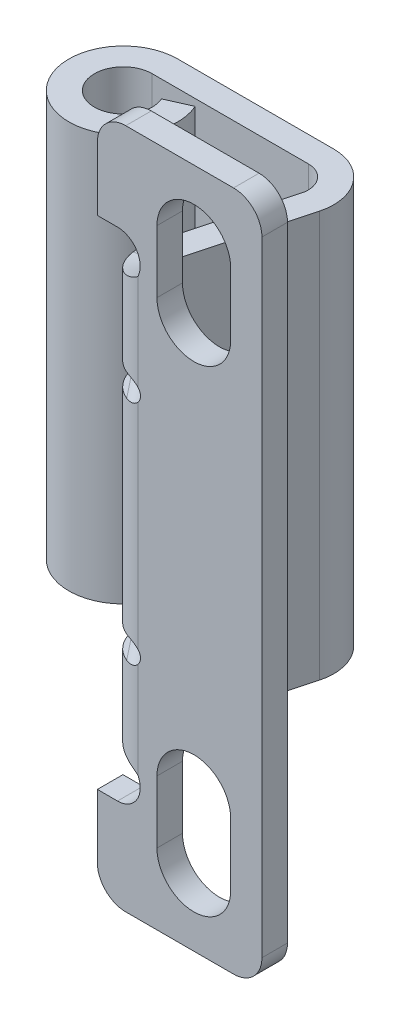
ISO-10303-21;
HEADER;
FILE_DESCRIPTION(('STEP AP214'),'2;1');
FILE_NAME('part.step','',(''),(''),'','','');
FILE_SCHEMA(('AUTOMOTIVE_DESIGN { 1 0 10303 214 1 1 1 1 }'));
ENDSEC;
DATA;
#1=APPLICATION_CONTEXT('core data for automotive mechanical design processes');
#2=APPLICATION_PROTOCOL_DEFINITION('international standard','automotive_design',2000,#1);
#3=PRODUCT_CONTEXT('',#1,'mechanical');
#4=PRODUCT('Part','Part','',(#3));
#5=PRODUCT_RELATED_PRODUCT_CATEGORY('part','',(#4));
#6=PRODUCT_DEFINITION_FORMATION('','',#4);
#7=PRODUCT_DEFINITION_CONTEXT('part definition',#1,'design');
#8=PRODUCT_DEFINITION('design','',#6,#7);
#9=PRODUCT_DEFINITION_SHAPE('','',#8);
#10=(LENGTH_UNIT() NAMED_UNIT(*) SI_UNIT(.MILLI.,.METRE.));
#11=(NAMED_UNIT(*) PLANE_ANGLE_UNIT() SI_UNIT($,.RADIAN.));
#12=(NAMED_UNIT(*) SI_UNIT($,.STERADIAN.) SOLID_ANGLE_UNIT());
#13=UNCERTAINTY_MEASURE_WITH_UNIT(LENGTH_MEASURE(1.E-05),#10,'distance_accuracy_value','');
#14=(GEOMETRIC_REPRESENTATION_CONTEXT(3) GLOBAL_UNCERTAINTY_ASSIGNED_CONTEXT((#13)) GLOBAL_UNIT_ASSIGNED_CONTEXT((#10,
#11,#12)) REPRESENTATION_CONTEXT('',''));
#15=CARTESIAN_POINT('',(0.,0.,0.));
#16=DIRECTION('',(0.,0.,1.));
#17=DIRECTION('',(1.,0.,0.));
#18=AXIS2_PLACEMENT_3D('',#15,#16,#17);
#19=CARTESIAN_POINT('',(-2.000248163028,13.25,-0.009347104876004));
#20=DIRECTION('',(0.619776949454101,3.18307778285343E-06,0.784778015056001));
#21=DIRECTION('',(0.784778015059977,0.,-0.619776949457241));
#22=AXIS2_PLACEMENT_3D('',#19,#20,#21);
#23=PLANE('',#22);
#24=CARTESIAN_POINT('',(-2.00024816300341,13.2500000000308,-0.00934710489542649));
#25=CARTESIAN_POINT('',(-1.61303404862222,13.2490337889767,-0.315148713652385));
#26=CARTESIAN_POINT('',(-1.24687244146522,13.1048574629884,-0.604323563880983));
#27=CARTESIAN_POINT('',(-0.88110518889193,12.9608364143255,-0.893186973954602));
#28=CARTESIAN_POINT('',(-0.560679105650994,12.6828364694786,-1.14624173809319));
#29=B_SPLINE_CURVE_WITH_KNOTS('',2,(#24,#25,#26,#27,#28),.UNSPECIFIED.,.F.,.F.,(3,2,3),(0.,0.5,
1.),.UNSPECIFIED.);
#30=CARTESIAN_POINT('',(-2.00024816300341,13.2500000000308,-0.00934710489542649));
#31=VERTEX_POINT('',#30);
#32=CARTESIAN_POINT('',(-0.560679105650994,12.6828364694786,-1.14624173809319));
#33=VERTEX_POINT('',#32);
#34=EDGE_CURVE('P0_E23',#31,#33,#29,.T.);
#35=ORIENTED_EDGE('',*,*,#34,.T.);
#36=DIRECTION('',(-1.97279823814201E-06,0.999999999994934,-2.49800946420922E-06));
#37=VECTOR('',#36,1.);
#38=CARTESIAN_POINT('',(-0.560680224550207,13.25,-1.14624315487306));
#39=LINE('',#38,#37);
#40=CARTESIAN_POINT('',(-0.560680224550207,13.2499999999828,-1.14624315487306));
#41=VERTEX_POINT('',#40);
#42=EDGE_CURVE('P0_E11',#33,#41,#39,.T.);
#43=ORIENTED_EDGE('',*,*,#42,.T.);
#44=DIRECTION('',(0.784778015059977,0.,-0.619776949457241));
#45=VECTOR('',#44,1.);
#46=CARTESIAN_POINT('',(-2.000248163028,13.2499999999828,-0.00934710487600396));
#47=LINE('',#46,#45);
#48=EDGE_CURVE('P0_E18',#41,#31,#47,.F.);
#49=ORIENTED_EDGE('',*,*,#48,.T.);
#50=EDGE_LOOP('',(#35,#43,#49));
#51=FACE_BOUND('',#50,.T.);
#52=ADVANCED_FACE('P0_F16',(#51),#23,.T.);
#53=OPEN_SHELL('',(#52));
#54=SHELL_BASED_SURFACE_MODEL('P0_B1',(#53));
#55=CARTESIAN_POINT('',(-3.071870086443,-9.,1.483984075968));
#56=DIRECTION('',(0.,1.,0.));
#57=DIRECTION('',(0.,0.,1.));
#58=AXIS2_PLACEMENT_3D('',#55,#56,#57);
#59=PLANE('',#58);
#60=CARTESIAN_POINT('',(0.2241010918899,-9.,-1.766015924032));
#61=DIRECTION('',(0.,-1.,0.));
#62=DIRECTION('',(0.,0.,-1.));
#63=AXIS2_PLACEMENT_3D('',#60,#61,#62);
#64=CIRCLE('',#63,3.25);
#65=CARTESIAN_POINT('',(-2.98584476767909,-9.,-1.25734355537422));
#66=VERTEX_POINT('',#65);
#67=CARTESIAN_POINT('',(-1.014655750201,-9.,1.23864403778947));
#68=VERTEX_POINT('',#67);
#69=EDGE_CURVE('P1_E324',#66,#68,#64,.F.);
#70=ORIENTED_EDGE('',*,*,#69,.F.);
#71=DIRECTION('',(0.619774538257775,0.,0.784779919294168));
#72=VECTOR('',#71,1.);
#73=CARTESIAN_POINT('',(-4.5041490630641,-9.,-3.17987287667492));
#74=LINE('',#73,#72);
#75=EDGE_CURVE('P1_E315',#66,#68,#74,.T.);
#76=ORIENTED_EDGE('',*,*,#75,.T.);
#77=EDGE_LOOP('',(#70,#76));
#78=FACE_BOUND('',#77,.T.);
#79=ADVANCED_FACE('P1_F16',(#78),#59,.F.);
#80=CARTESIAN_POINT('',(-3.071870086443,9.,1.483984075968));
#81=DIRECTION('',(0.,1.,0.));
#82=DIRECTION('',(0.,0.,1.));
#83=AXIS2_PLACEMENT_3D('',#80,#81,#82);
#84=PLANE('',#83);
#85=DIRECTION('',(-0.619774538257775,0.,-0.784779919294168));
#86=VECTOR('',#85,1.);
#87=CARTESIAN_POINT('',(-0.284785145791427,9.,2.16283139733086));
#88=LINE('',#87,#86);
#89=CARTESIAN_POINT('',(-1.01465575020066,9.,1.23864403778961));
#90=VERTEX_POINT('',#89);
#91=CARTESIAN_POINT('',(-2.98584476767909,9.,-1.25734355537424));
#92=VERTEX_POINT('',#91);
#93=EDGE_CURVE('P1_E498',#90,#92,#88,.T.);
#94=ORIENTED_EDGE('',*,*,#93,.T.);
#95=CARTESIAN_POINT('',(0.2241010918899,9.,-1.766015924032));
#96=DIRECTION('',(0.,-1.,0.));
#97=DIRECTION('',(0.,0.,-1.));
#98=AXIS2_PLACEMENT_3D('',#95,#96,#97);
#99=CIRCLE('',#98,3.25);
#100=EDGE_CURVE('P1_E691',#90,#92,#99,.T.);
#101=ORIENTED_EDGE('',*,*,#100,.F.);
#102=EDGE_LOOP('',(#94,#101));
#103=FACE_BOUND('',#102,.T.);
#104=ADVANCED_FACE('P1_F712',(#103),#84,.T.);
#105=CARTESIAN_POINT('',(-4.504149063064,-10.,-3.179872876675));
#106=DIRECTION('',(0.619774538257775,0.,0.784779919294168));
#107=DIRECTION('',(0.784779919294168,0.,-0.619774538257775));
#108=AXIS2_PLACEMENT_3D('',#105,#106,#107);
#109=CYLINDRICAL_SURFACE('',#108,1.);
#110=DIRECTION('',(-0.619774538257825,0.,-0.784779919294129));
#111=VECTOR('',#110,1.);
#112=CARTESIAN_POINT('',(-1.014655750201,-11.,1.238644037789));
#113=LINE('',#112,#111);
#114=CARTESIAN_POINT('',(-1.01465575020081,-11.,1.23864403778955));
#115=VERTEX_POINT('',#114);
#116=CARTESIAN_POINT('',(-2.98584476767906,-11.,-1.25734355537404));
#117=VERTEX_POINT('',#116);
#118=EDGE_CURVE('P1_E501',#115,#117,#113,.T.);
#119=ORIENTED_EDGE('',*,*,#118,.F.);
#120=CARTESIAN_POINT('',(0.224101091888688,-10.5722259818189,1.483984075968));
#121=CARTESIAN_POINT('',(0.203230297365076,-10.5957060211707,1.48398562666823));
#122=CARTESIAN_POINT('',(0.181215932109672,-10.6181325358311,1.48378280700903));
#123=CARTESIAN_POINT('',(0.135240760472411,-10.6608120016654,1.48285006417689));
#124=CARTESIAN_POINT('',(0.11128291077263,-10.6810681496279,1.48212092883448));
#125=CARTESIAN_POINT('',(0.0376676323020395,-10.7379918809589,1.47899876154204));
#126=CARTESIAN_POINT('',(-0.0143926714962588,-10.7715374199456,1.47567798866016));
#127=CARTESIAN_POINT('',(-0.135729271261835,-10.8376342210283,1.46470689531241));
#128=CARTESIAN_POINT('',(-0.206115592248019,-10.8679644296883,1.45620080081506));
#129=CARTESIAN_POINT('',(-0.350369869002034,-10.9180186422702,1.43365207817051));
#130=CARTESIAN_POINT('',(-0.424264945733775,-10.9376370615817,1.41955661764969));
#131=CARTESIAN_POINT('',(-0.542170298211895,-10.9618045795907,1.39268027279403));
#132=CARTESIAN_POINT('',(-0.586055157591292,-10.9692356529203,1.38171530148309));
#133=CARTESIAN_POINT('',(-0.673693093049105,-10.9814509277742,1.35784796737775));
#134=CARTESIAN_POINT('',(-0.717446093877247,-10.9862338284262,1.34494465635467));
#135=CARTESIAN_POINT('',(-0.80381528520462,-10.9935040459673,1.31747373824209));
#136=CARTESIAN_POINT('',(-0.846438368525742,-10.9960276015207,1.30293677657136));
#137=CARTESIAN_POINT('',(-0.931049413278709,-10.9992716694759,1.27210139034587));
#138=CARTESIAN_POINT('',(-0.973038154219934,-10.9999946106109,1.25580536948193));
#139=CARTESIAN_POINT('',(-1.01465575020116,-11.,1.2386440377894));
#140=B_SPLINE_CURVE_WITH_KNOTS('',3,(#120,#121,#122,#123,#124,#125,#126,#127,#128,#129,#130,
#131,#132,#133,#134,#135,#136,#137,#138,#139),.UNSPECIFIED.,.F.,.F.,(4,2,2,2,2,2,2,2,2,4),(0.,
0.0941601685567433,0.188179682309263,0.373324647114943,0.603444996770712,0.835794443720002,
0.973211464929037,1.11069593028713,1.24593352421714,1.38098860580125),.UNSPECIFIED.);
#141=CARTESIAN_POINT('',(0.224101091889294,-10.5722259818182,1.483984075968));
#142=VERTEX_POINT('',#141);
#143=EDGE_CURVE('P1_E505',#142,#115,#140,.T.);
#144=ORIENTED_EDGE('',*,*,#143,.F.);
#145=CARTESIAN_POINT('',(-0.820900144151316,-10.,1.483984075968));
#146=DIRECTION('',(0.,0.,-1.));
#147=DIRECTION('',(1.,0.,0.));
#148=AXIS2_PLACEMENT_3D('',#145,#146,#147);
#149=ELLIPSE('',#148,1.27424259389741,1.);
#150=CARTESIAN_POINT('',(0.224101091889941,-9.42777401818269,1.48398407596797));
#151=VERTEX_POINT('',#150);
#152=EDGE_CURVE('P1_E504',#142,#151,#149,.F.);
#153=ORIENTED_EDGE('',*,*,#152,.T.);
#154=CARTESIAN_POINT('',(-1.01465575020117,-9.,1.2386440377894));
#155=CARTESIAN_POINT('',(-0.959499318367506,-9.00001647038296,1.26139681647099));
#156=CARTESIAN_POINT('',(-0.903662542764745,-9.00128037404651,1.28262714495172));
#157=CARTESIAN_POINT('',(-0.790827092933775,-9.00718546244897,1.32202347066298));
#158=CARTESIAN_POINT('',(-0.733824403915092,-9.01184139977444,1.34017565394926));
#159=CARTESIAN_POINT('',(-0.618261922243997,-9.02555686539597,1.37350803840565));
#160=CARTESIAN_POINT('',(-0.559693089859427,-9.03469815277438,1.38862541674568));
#161=CARTESIAN_POINT('',(-0.442962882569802,-9.05844066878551,1.41535178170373));
#162=CARTESIAN_POINT('',(-0.384800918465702,-9.07303066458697,1.42696789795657));
#163=CARTESIAN_POINT('',(-0.265447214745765,-9.11011385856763,1.44751458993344));
#164=CARTESIAN_POINT('',(-0.204365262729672,-9.13312741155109,1.45617084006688));
#165=CARTESIAN_POINT('',(-0.0862822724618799,-9.18770972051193,1.46966859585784));
#166=CARTESIAN_POINT('',(-0.0292486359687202,-9.21919713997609,1.47454474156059));
#167=CARTESIAN_POINT('',(0.0611638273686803,-9.27971000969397,1.48010289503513));
#168=CARTESIAN_POINT('',(0.0961944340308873,-9.30619386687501,1.48163385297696));
#169=CARTESIAN_POINT('',(0.162963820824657,-9.36363928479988,1.4835847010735));
#170=CARTESIAN_POINT('',(0.194668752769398,-9.39464040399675,1.48399406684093));
#171=CARTESIAN_POINT('',(0.224101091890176,-9.42777401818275,1.483984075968));
#172=B_SPLINE_CURVE_WITH_KNOTS('',3,(#154,#155,#156,#157,#158,#159,#160,#161,#162,#163,#164,
#165,#166,#167,#168,#169,#170,#171),.UNSPECIFIED.,.F.,.F.,(4,2,2,2,2,2,2,2,4),(0.,
0.179033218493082,0.358849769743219,0.54207312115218,0.724920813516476,0.921793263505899,
1.11683956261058,1.24832411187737,1.38103827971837),.UNSPECIFIED.);
#173=EDGE_CURVE('P1_E416',#68,#151,#172,.T.);
#174=ORIENTED_EDGE('',*,*,#173,.F.);
#175=ORIENTED_EDGE('',*,*,#75,.F.);
#176=CARTESIAN_POINT('',(-2.91515784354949,-9.54809602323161,-2.60717782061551));
#177=CARTESIAN_POINT('',(-2.9191154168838,-9.52388720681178,-2.5924065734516));
#178=CARTESIAN_POINT('',(-2.92326817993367,-9.50043443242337,-2.57649190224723));
#179=CARTESIAN_POINT('',(-2.93180688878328,-9.45516869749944,-2.54257991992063));
#180=CARTESIAN_POINT('',(-2.9361925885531,-9.43335406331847,-2.52458478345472));
#181=CARTESIAN_POINT('',(-2.94939551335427,-9.37087083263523,-2.4680830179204));
#182=CARTESIAN_POINT('',(-2.95833686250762,-9.33271483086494,-2.42678156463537));
#183=CARTESIAN_POINT('',(-2.97536443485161,-9.26371235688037,-2.33866343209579));
#184=CARTESIAN_POINT('',(-2.9834536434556,-9.23283986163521,-2.2918673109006));
#185=CARTESIAN_POINT('',(-2.99795755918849,-9.177867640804,-2.19414134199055));
#186=CARTESIAN_POINT('',(-3.00436885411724,-9.15378170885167,-2.14320334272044));
#187=CARTESIAN_POINT('',(-3.0177898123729,-9.10015201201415,-2.0095187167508));
#188=CARTESIAN_POINT('',(-3.02314887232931,-9.07502387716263,-1.92483833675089));
#189=CARTESIAN_POINT('',(-3.02702273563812,-9.03667979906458,-1.75258404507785));
#190=CARTESIAN_POINT('',(-3.02551507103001,-9.02350312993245,-1.66500156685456));
#191=CARTESIAN_POINT('',(-3.01729697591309,-9.00941177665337,-1.52367506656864));
#192=CARTESIAN_POINT('',(-3.01284034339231,-9.00572052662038,-1.47003053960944));
#193=CARTESIAN_POINT('',(-3.00129566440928,-9.00102920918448,-1.3632988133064));
#194=CARTESIAN_POINT('',(-2.99422704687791,-9.00000971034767,-1.31021040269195));
#195=CARTESIAN_POINT('',(-2.98584476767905,-9.,-1.25734355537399));
#196=B_SPLINE_CURVE_WITH_KNOTS('',3,(#176,#177,#178,#179,#180,#181,#182,#183,#184,#185,#186,
#187,#188,#189,#190,#191,#192,#193,#194,#195),.UNSPECIFIED.,.F.,.F.,(4,2,2,2,2,2,2,2,2,4),(0.,
0.0858304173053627,0.171571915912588,0.341478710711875,0.510768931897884,0.680400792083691,
0.944382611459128,1.20922880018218,1.37097585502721,1.53154322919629),.UNSPECIFIED.);
#197=CARTESIAN_POINT('',(-2.91515784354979,-9.54809602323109,-2.60717782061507));
#198=VERTEX_POINT('',#197);
#199=EDGE_CURVE('P1_E317',#198,#66,#196,.T.);
#200=ORIENTED_EDGE('',*,*,#199,.F.);
#201=CARTESIAN_POINT('',(-3.20312469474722,-10.,-1.53247090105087));
#202=DIRECTION('',(0.965925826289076,0.,0.258819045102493));
#203=DIRECTION('',(-0.258819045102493,0.,0.965925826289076));
#204=AXIS2_PLACEMENT_3D('',#201,#202,#203);
#205=ELLIPSE('',#204,1.24723702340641,1.);
#206=CARTESIAN_POINT('',(-2.91515784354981,-10.4519039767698,-2.60717782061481));
#207=VERTEX_POINT('',#206);
#208=EDGE_CURVE('P1_E23',#207,#198,#205,.T.);
#209=ORIENTED_EDGE('',*,*,#208,.F.);
#210=CARTESIAN_POINT('',(-2.98584476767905,-11.,-1.25734355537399));
#211=CARTESIAN_POINT('',(-2.99522026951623,-10.9999833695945,-1.31642927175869));
#212=CARTESIAN_POINT('',(-3.0029481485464,-10.9987127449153,-1.37582619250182));
#213=CARTESIAN_POINT('',(-3.01513608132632,-10.9927737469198,-1.49504008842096));
#214=CARTESIAN_POINT('',(-3.01958171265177,-10.9880905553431,-1.55485776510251));
#215=CARTESIAN_POINT('',(-3.02518834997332,-10.9743287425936,-1.67499514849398));
#216=CARTESIAN_POINT('',(-3.02630402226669,-10.9651914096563,-1.73531067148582));
#217=CARTESIAN_POINT('',(-3.02523488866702,-10.9414826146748,-1.8547360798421));
#218=CARTESIAN_POINT('',(-3.0230568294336,-10.9269223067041,-1.91384817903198));
#219=CARTESIAN_POINT('',(-3.01543877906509,-10.8901090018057,-2.03383517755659));
#220=CARTESIAN_POINT('',(-3.00978992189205,-10.8674057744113,-2.09456263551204));
#221=CARTESIAN_POINT('',(-2.99574802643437,-10.8135244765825,-2.21157413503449));
#222=CARTESIAN_POINT('',(-2.98736699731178,-10.7823835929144,-2.26787630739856));
#223=CARTESIAN_POINT('',(-2.97030442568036,-10.7160785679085,-2.36635378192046));
#224=CARTESIAN_POINT('',(-2.96184175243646,-10.682148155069,-2.4093944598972));
#225=CARTESIAN_POINT('',(-2.94468849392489,-10.607580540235,-2.48915696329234));
#226=CARTESIAN_POINT('',(-2.93599835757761,-10.5669558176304,-2.52589029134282));
#227=CARTESIAN_POINT('',(-2.92558156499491,-10.5118531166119,-2.56731481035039));
#228=CARTESIAN_POINT('',(-2.92343705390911,-10.5001365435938,-2.57569126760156));
#229=CARTESIAN_POINT('',(-2.91923105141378,-10.4763122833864,-2.59186832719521));
#230=CARTESIAN_POINT('',(-2.91716949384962,-10.4642049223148,-2.59966939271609));
#231=CARTESIAN_POINT('',(-2.9151578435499,-10.4519039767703,-2.6071778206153));
#232=B_SPLINE_CURVE_WITH_KNOTS('',3,(#210,#211,#212,#213,#214,#215,#216,#217,#218,#219,#220,
#221,#222,#223,#224,#225,#226,#227,#228,#229,#230,#231),.UNSPECIFIED.,.F.,.F.,(4,2,2,2,2,2,2,2,
2,2,4),(0.,0.179513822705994,0.359811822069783,0.542553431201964,0.724921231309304,
0.919513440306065,1.11326160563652,1.27898136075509,1.44439560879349,1.48806910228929,
1.53170704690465),.UNSPECIFIED.);
#233=EDGE_CURVE('P1_E411',#117,#207,#232,.T.);
#234=ORIENTED_EDGE('',*,*,#233,.F.);
#235=EDGE_LOOP('',(#119,#144,#153,#174,#175,#200,#209,#234));
#236=FACE_BOUND('',#235,.T.);
#237=ADVANCED_FACE('P1_F319',(#236),#109,.F.);
#238=CARTESIAN_POINT('',(-3.071870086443,-11.,1.483984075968));
#239=DIRECTION('',(0.,1.,0.));
#240=DIRECTION('',(0.,0.,1.));
#241=AXIS2_PLACEMENT_3D('',#238,#239,#240);
#242=PLANE('',#241);
#243=ORIENTED_EDGE('',*,*,#118,.T.);
#244=CARTESIAN_POINT('',(0.2241010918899,-11.,-1.766015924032));
#245=DIRECTION('',(0.,-1.,0.));
#246=DIRECTION('',(0.,0.,-1.));
#247=AXIS2_PLACEMENT_3D('',#244,#245,#246);
#248=CIRCLE('',#247,3.25);
#249=EDGE_CURVE('P1_E410',#115,#117,#248,.T.);
#250=ORIENTED_EDGE('',*,*,#249,.F.);
#251=EDGE_LOOP('',(#243,#250));
#252=FACE_BOUND('',#251,.T.);
#253=ADVANCED_FACE('P1_F711',(#252),#242,.T.);
#254=CARTESIAN_POINT('',(12.92410109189,30.,1.483984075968));
#255=DIRECTION('',(0.,0.,-1.));
#256=DIRECTION('',(-1.,0.,0.));
#257=AXIS2_PLACEMENT_3D('',#254,#255,#256);
#258=PLANE('',#257);
#259=DIRECTION('',(0.,1.,0.));
#260=VECTOR('',#259,1.);
#261=CARTESIAN_POINT('',(1.9,21.,1.483984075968));
#262=LINE('',#261,#260);
#263=CARTESIAN_POINT('',(1.9,23.75,1.483984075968));
#264=VERTEX_POINT('',#263);
#265=CARTESIAN_POINT('',(1.9,18.25,1.483984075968));
#266=VERTEX_POINT('',#265);
#267=EDGE_CURVE('P1_E443',#264,#266,#262,.F.);
#268=ORIENTED_EDGE('',*,*,#267,.F.);
#269=CARTESIAN_POINT('',(5.15,23.75,1.483984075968));
#270=DIRECTION('',(0.,0.,1.));
#271=DIRECTION('',(1.,0.,0.));
#272=AXIS2_PLACEMENT_3D('',#269,#270,#271);
#273=CIRCLE('',#272,3.25);
#274=CARTESIAN_POINT('',(8.4,23.75,1.483984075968));
#275=VERTEX_POINT('',#274);
#276=EDGE_CURVE('P1_E444',#264,#275,#273,.F.);
#277=ORIENTED_EDGE('',*,*,#276,.T.);
#278=DIRECTION('',(0.,1.,0.));
#279=VECTOR('',#278,1.);
#280=CARTESIAN_POINT('',(8.4,21.,1.483984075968));
#281=LINE('',#280,#279);
#282=CARTESIAN_POINT('',(8.4,18.25,1.483984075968));
#283=VERTEX_POINT('',#282);
#284=EDGE_CURVE('P1_E433',#283,#275,#281,.T.);
#285=ORIENTED_EDGE('',*,*,#284,.F.);
#286=CARTESIAN_POINT('',(5.15,18.25,1.483984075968));
#287=DIRECTION('',(0.,0.,1.));
#288=DIRECTION('',(1.,0.,0.));
#289=AXIS2_PLACEMENT_3D('',#286,#287,#288);
#290=CIRCLE('',#289,3.25);
#291=EDGE_CURVE('P1_E439',#283,#266,#290,.F.);
#292=ORIENTED_EDGE('',*,*,#291,.T.);
#293=EDGE_LOOP('',(#268,#277,#285,#292));
#294=FACE_BOUND('',#293,.T.);
#295=CARTESIAN_POINT('',(5.15,-18.25,1.483984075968));
#296=DIRECTION('',(0.,0.,1.));
#297=DIRECTION('',(1.,0.,0.));
#298=AXIS2_PLACEMENT_3D('',#295,#296,#297);
#299=CIRCLE('',#298,3.25);
#300=CARTESIAN_POINT('',(1.9,-18.25,1.483984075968));
#301=VERTEX_POINT('',#300);
#302=CARTESIAN_POINT('',(8.4,-18.25,1.483984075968));
#303=VERTEX_POINT('',#302);
#304=EDGE_CURVE('P1_E429',#301,#303,#299,.F.);
#305=ORIENTED_EDGE('',*,*,#304,.T.);
#306=DIRECTION('',(0.,1.,0.));
#307=VECTOR('',#306,1.);
#308=CARTESIAN_POINT('',(8.4,-21.,1.483984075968));
#309=LINE('',#308,#307);
#310=CARTESIAN_POINT('',(8.4,-23.75,1.483984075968));
#311=VERTEX_POINT('',#310);
#312=EDGE_CURVE('P1_E507',#311,#303,#309,.T.);
#313=ORIENTED_EDGE('',*,*,#312,.F.);
#314=CARTESIAN_POINT('',(5.15,-23.75,1.483984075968));
#315=DIRECTION('',(0.,0.,1.));
#316=DIRECTION('',(1.,0.,0.));
#317=AXIS2_PLACEMENT_3D('',#314,#315,#316);
#318=CIRCLE('',#317,3.25);
#319=CARTESIAN_POINT('',(1.9,-23.75,1.483984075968));
#320=VERTEX_POINT('',#319);
#321=EDGE_CURVE('P1_E420',#311,#320,#318,.F.);
#322=ORIENTED_EDGE('',*,*,#321,.T.);
#323=DIRECTION('',(0.,1.,0.));
#324=VECTOR('',#323,1.);
#325=CARTESIAN_POINT('',(1.9,-21.,1.483984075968));
#326=LINE('',#325,#324);
#327=EDGE_CURVE('P1_E426',#301,#320,#326,.F.);
#328=ORIENTED_EDGE('',*,*,#327,.F.);
#329=EDGE_LOOP('',(#305,#313,#322,#328));
#330=FACE_BOUND('',#329,.T.);
#331=ORIENTED_EDGE('',*,*,#152,.F.);
#332=DIRECTION('',(0.,-1.,0.));
#333=VECTOR('',#332,1.);
#334=CARTESIAN_POINT('',(0.2241010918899,17.9,1.483984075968));
#335=LINE('',#334,#333);
#336=CARTESIAN_POINT('',(0.224101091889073,-19.0282202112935,1.483984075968));
#337=VERTEX_POINT('',#336);
#338=EDGE_CURVE('P1_E407',#337,#142,#335,.F.);
#339=ORIENTED_EDGE('',*,*,#338,.F.);
#340=CARTESIAN_POINT('',(-1.57589890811,-19.9,1.483984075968));
#341=DIRECTION('',(0.,0.,-1.));
#342=DIRECTION('',(-1.,0.,0.));
#343=AXIS2_PLACEMENT_3D('',#340,#341,#342);
#344=CIRCLE('',#343,2.);
#345=CARTESIAN_POINT('',(-1.57589890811,-21.9,1.483984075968));
#346=VERTEX_POINT('',#345);
#347=EDGE_CURVE('P1_E447',#337,#346,#344,.T.);
#348=ORIENTED_EDGE('',*,*,#347,.T.);
#349=DIRECTION('',(1.,0.,0.));
#350=VECTOR('',#349,1.);
#351=CARTESIAN_POINT('',(-2.462949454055,-21.9,1.483984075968));
#352=LINE('',#351,#350);
#353=CARTESIAN_POINT('',(-3.35,-21.9,1.483984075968));
#354=VERTEX_POINT('',#353);
#355=EDGE_CURVE('P1_E451',#354,#346,#352,.T.);
#356=ORIENTED_EDGE('',*,*,#355,.F.);
#357=DIRECTION('',(0.,1.,0.));
#358=VECTOR('',#357,1.);
#359=CARTESIAN_POINT('',(-3.35,-25.95,1.483984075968));
#360=LINE('',#359,#358);
#361=CARTESIAN_POINT('',(-3.35,-27.5,1.483984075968));
#362=VERTEX_POINT('',#361);
#363=EDGE_CURVE('P1_E457',#362,#354,#360,.T.);
#364=ORIENTED_EDGE('',*,*,#363,.F.);
#365=CARTESIAN_POINT('',(-0.85,-27.5,1.483984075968));
#366=DIRECTION('',(0.,0.,1.));
#367=DIRECTION('',(1.,0.,0.));
#368=AXIS2_PLACEMENT_3D('',#365,#366,#367);
#369=CIRCLE('',#368,2.5);
#370=CARTESIAN_POINT('',(-0.84999999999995,-30.,1.483984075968));
#371=VERTEX_POINT('',#370);
#372=EDGE_CURVE('P1_E461',#371,#362,#369,.F.);
#373=ORIENTED_EDGE('',*,*,#372,.F.);
#374=DIRECTION('',(1.,0.,0.));
#375=VECTOR('',#374,1.);
#376=CARTESIAN_POINT('',(-0.07589890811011,-30.,1.483984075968));
#377=LINE('',#376,#375);
#378=CARTESIAN_POINT('',(8.65,-30.,1.483984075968));
#379=VERTEX_POINT('',#378);
#380=EDGE_CURVE('P1_E465',#379,#371,#377,.F.);
#381=ORIENTED_EDGE('',*,*,#380,.F.);
#382=CARTESIAN_POINT('',(8.65,-27.5,1.483984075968));
#383=DIRECTION('',(0.,0.,1.));
#384=DIRECTION('',(1.,0.,0.));
#385=AXIS2_PLACEMENT_3D('',#382,#383,#384);
#386=CIRCLE('',#385,2.5);
#387=CARTESIAN_POINT('',(11.15,-27.5,1.483984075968));
#388=VERTEX_POINT('',#387);
#389=EDGE_CURVE('P1_E469',#388,#379,#386,.F.);
#390=ORIENTED_EDGE('',*,*,#389,.F.);
#391=DIRECTION('',(0.,1.,0.));
#392=VECTOR('',#391,1.);
#393=CARTESIAN_POINT('',(11.15,0.,1.483984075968));
#394=LINE('',#393,#392);
#395=CARTESIAN_POINT('',(11.15,27.5,1.483984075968));
#396=VERTEX_POINT('',#395);
#397=EDGE_CURVE('P1_E473',#396,#388,#394,.F.);
#398=ORIENTED_EDGE('',*,*,#397,.F.);
#399=CARTESIAN_POINT('',(8.65,27.5,1.483984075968));
#400=DIRECTION('',(0.,0.,1.));
#401=DIRECTION('',(1.,0.,0.));
#402=AXIS2_PLACEMENT_3D('',#399,#400,#401);
#403=CIRCLE('',#402,2.5);
#404=CARTESIAN_POINT('',(8.65,30.,1.483984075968));
#405=VERTEX_POINT('',#404);
#406=EDGE_CURVE('P1_E477',#405,#396,#403,.F.);
#407=ORIENTED_EDGE('',*,*,#406,.F.);
#408=DIRECTION('',(1.,0.,0.));
#409=VECTOR('',#408,1.);
#410=CARTESIAN_POINT('',(-0.07589890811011,30.,1.483984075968));
#411=LINE('',#410,#409);
#412=CARTESIAN_POINT('',(-0.85000008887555,30.,1.483984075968));
#413=VERTEX_POINT('',#412);
#414=EDGE_CURVE('P1_E478',#405,#413,#411,.F.);
#415=ORIENTED_EDGE('',*,*,#414,.T.);
#416=CARTESIAN_POINT('',(-0.85,27.5,1.483984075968));
#417=DIRECTION('',(0.,0.,1.));
#418=DIRECTION('',(1.,0.,0.));
#419=AXIS2_PLACEMENT_3D('',#416,#417,#418);
#420=CIRCLE('',#419,2.5);
#421=CARTESIAN_POINT('',(-3.35,27.5,1.483984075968));
#422=VERTEX_POINT('',#421);
#423=EDGE_CURVE('P1_E481',#422,#413,#420,.F.);
#424=ORIENTED_EDGE('',*,*,#423,.F.);
#425=DIRECTION('',(0.,1.,0.));
#426=VECTOR('',#425,1.);
#427=CARTESIAN_POINT('',(-3.35,25.95,1.483984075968));
#428=LINE('',#427,#426);
#429=CARTESIAN_POINT('',(-3.35,21.9,1.483984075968));
#430=VERTEX_POINT('',#429);
#431=EDGE_CURVE('P1_E485',#430,#422,#428,.T.);
#432=ORIENTED_EDGE('',*,*,#431,.F.);
#433=DIRECTION('',(1.,0.,0.));
#434=VECTOR('',#433,1.);
#435=CARTESIAN_POINT('',(-2.462949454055,21.9,1.483984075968));
#436=LINE('',#435,#434);
#437=CARTESIAN_POINT('',(-1.57589890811,21.9,1.483984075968));
#438=VERTEX_POINT('',#437);
#439=EDGE_CURVE('P1_E489',#438,#430,#436,.F.);
#440=ORIENTED_EDGE('',*,*,#439,.F.);
#441=CARTESIAN_POINT('',(-1.57589890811,19.9,1.483984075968));
#442=DIRECTION('',(0.,0.,-1.));
#443=DIRECTION('',(-1.,0.,0.));
#444=AXIS2_PLACEMENT_3D('',#441,#442,#443);
#445=CIRCLE('',#444,2.);
#446=CARTESIAN_POINT('',(0.22410109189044,19.0282202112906,1.483984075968));
#447=VERTEX_POINT('',#446);
#448=EDGE_CURVE('P1_E495',#438,#447,#445,.T.);
#449=ORIENTED_EDGE('',*,*,#448,.T.);
#450=DIRECTION('',(0.,-1.,0.));
#451=VECTOR('',#450,1.);
#452=CARTESIAN_POINT('',(0.2241010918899,17.9,1.483984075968));
#453=LINE('',#452,#451);
#454=CARTESIAN_POINT('',(0.224101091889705,10.5722259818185,1.48398407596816));
#455=VERTEX_POINT('',#454);
#456=EDGE_CURVE('P1_E402',#455,#447,#453,.F.);
#457=ORIENTED_EDGE('',*,*,#456,.F.);
#458=CARTESIAN_POINT('',(-0.820900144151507,10.,1.483984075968));
#459=DIRECTION('',(0.,0.,-1.));
#460=DIRECTION('',(-1.,0.,0.));
#461=AXIS2_PLACEMENT_3D('',#458,#459,#460);
#462=ELLIPSE('',#461,1.27424259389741,1.);
#463=CARTESIAN_POINT('',(0.224101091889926,9.42777401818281,1.48398407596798));
#464=VERTEX_POINT('',#463);
#465=EDGE_CURVE('P1_E500',#455,#464,#462,.T.);
#466=ORIENTED_EDGE('',*,*,#465,.T.);
#467=DIRECTION('',(0.,-1.,0.));
#468=VECTOR('',#467,1.);
#469=CARTESIAN_POINT('',(0.2241010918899,17.9,1.483984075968));
#470=LINE('',#469,#468);
#471=EDGE_CURVE('P1_E412',#151,#464,#470,.F.);
#472=ORIENTED_EDGE('',*,*,#471,.F.);
#473=EDGE_LOOP('',(#331,#339,#348,#356,#364,#373,#381,#390,#398,#407,#415,#424,#432,#440,#449,
#457,#466,#472));
#474=FACE_BOUND('',#473,.T.);
#475=ADVANCED_FACE('P1_F673',(#294,#330,#474),#258,.F.);
#476=CARTESIAN_POINT('',(-0.2847851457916,10.,2.162831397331));
#477=DIRECTION('',(-0.619774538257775,0.,-0.784779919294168));
#478=DIRECTION('',(-0.784779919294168,0.,0.619774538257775));
#479=AXIS2_PLACEMENT_3D('',#476,#477,#478);
#480=CYLINDRICAL_SURFACE('',#479,1.);
#481=ORIENTED_EDGE('',*,*,#93,.F.);
#482=CARTESIAN_POINT('',(0.224101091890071,9.42777401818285,1.483984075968));
#483=CARTESIAN_POINT('',(0.203230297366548,9.40429397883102,1.48398562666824));
#484=CARTESIAN_POINT('',(0.181215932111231,9.38186746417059,1.48378280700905));
#485=CARTESIAN_POINT('',(0.135240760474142,9.33918799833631,1.48285006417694));
#486=CARTESIAN_POINT('',(0.111282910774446,9.31893185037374,1.48212092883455));
#487=CARTESIAN_POINT('',(0.0376676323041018,9.26200811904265,1.47899876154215));
#488=CARTESIAN_POINT('',(-0.0143926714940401,9.22846258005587,1.47567798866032));
#489=CARTESIAN_POINT('',(-0.135729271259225,9.16236577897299,1.4647068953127));
#490=CARTESIAN_POINT('',(-0.206115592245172,9.13203557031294,1.45620080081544));
#491=CARTESIAN_POINT('',(-0.350369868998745,9.08198135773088,1.4336520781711));
#492=CARTESIAN_POINT('',(-0.424264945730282,9.06236293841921,1.41955661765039));
#493=CARTESIAN_POINT('',(-0.542170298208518,9.03819542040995,1.39268027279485));
#494=CARTESIAN_POINT('',(-0.586055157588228,9.03076434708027,1.38171530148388));
#495=CARTESIAN_POINT('',(-0.673693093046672,9.01854907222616,1.35784796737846));
#496=CARTESIAN_POINT('',(-0.717446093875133,9.01376617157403,1.34494465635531));
#497=CARTESIAN_POINT('',(-0.803815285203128,9.00649595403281,1.31747373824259));
#498=CARTESIAN_POINT('',(-0.846438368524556,9.00397239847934,1.30293677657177));
#499=CARTESIAN_POINT('',(-0.931049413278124,9.00072833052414,1.27210139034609));
#500=CARTESIAN_POINT('',(-0.973038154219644,9.00000538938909,1.25580536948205));
#501=CARTESIAN_POINT('',(-1.01465575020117,9.,1.2386440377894));
#502=B_SPLINE_CURVE_WITH_KNOTS('',3,(#482,#483,#484,#485,#486,#487,#488,#489,#490,#491,#492,
#493,#494,#495,#496,#497,#498,#499,#500,#501),.UNSPECIFIED.,.F.,.F.,(4,2,2,2,2,2,2,2,2,4),(0.,
0.094160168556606,0.188179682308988,0.37332464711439,0.603444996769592,0.83579444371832,
0.973211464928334,1.11069593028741,1.24593352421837,1.38098860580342),.UNSPECIFIED.);
#503=EDGE_CURVE('P1_E415',#464,#90,#502,.T.);
#504=ORIENTED_EDGE('',*,*,#503,.F.);
#505=ORIENTED_EDGE('',*,*,#465,.F.);
#506=CARTESIAN_POINT('',(-1.01465575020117,11.,1.2386440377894));
#507=CARTESIAN_POINT('',(-0.959499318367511,10.999983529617,1.26139681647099));
#508=CARTESIAN_POINT('',(-0.903662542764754,10.9987196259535,1.28262714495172));
#509=CARTESIAN_POINT('',(-0.790827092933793,10.992814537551,1.32202347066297));
#510=CARTESIAN_POINT('',(-0.733824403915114,10.9881586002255,1.34017565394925));
#511=CARTESIAN_POINT('',(-0.61826192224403,10.974443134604,1.37350803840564));
#512=CARTESIAN_POINT('',(-0.559693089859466,10.9653018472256,1.38862541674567));
#513=CARTESIAN_POINT('',(-0.442962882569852,10.9415593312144,1.41535178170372));
#514=CARTESIAN_POINT('',(-0.384800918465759,10.926969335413,1.42696789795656));
#515=CARTESIAN_POINT('',(-0.265447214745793,10.8898861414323,1.44751458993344));
#516=CARTESIAN_POINT('',(-0.204365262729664,10.8668725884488,1.45617084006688));
#517=CARTESIAN_POINT('',(-0.0862822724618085,10.8122902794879,1.46966859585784));
#518=CARTESIAN_POINT('',(-0.0292486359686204,10.7808028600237,1.4745447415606));
#519=CARTESIAN_POINT('',(0.0611638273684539,10.720289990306,1.48010289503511));
#520=CARTESIAN_POINT('',(0.0961944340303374,10.6938061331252,1.48163385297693));
#521=CARTESIAN_POINT('',(0.162963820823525,10.636360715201,1.48358470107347));
#522=CARTESIAN_POINT('',(0.194668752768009,10.6053595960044,1.48399406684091));
#523=CARTESIAN_POINT('',(0.224101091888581,10.5722259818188,1.483984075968));
#524=B_SPLINE_CURVE_WITH_KNOTS('',3,(#506,#507,#508,#509,#510,#511,#512,#513,#514,#515,#516,
#517,#518,#519,#520,#521,#522,#523),.UNSPECIFIED.,.F.,.F.,(4,2,2,2,2,2,2,2,4),(0.,
0.179033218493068,0.358849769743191,0.542073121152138,0.724920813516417,0.921793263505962,
1.11683956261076,1.24832411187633,1.38103827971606),.UNSPECIFIED.);
#525=CARTESIAN_POINT('',(-1.01465575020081,11.,1.23864403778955));
#526=VERTEX_POINT('',#525);
#527=EDGE_CURVE('P1_E406',#526,#455,#524,.T.);
#528=ORIENTED_EDGE('',*,*,#527,.F.);
#529=DIRECTION('',(-0.619774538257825,0.,-0.784779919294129));
#530=VECTOR('',#529,1.);
#531=CARTESIAN_POINT('',(-1.014655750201,11.,1.238644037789));
#532=LINE('',#531,#530);
#533=CARTESIAN_POINT('',(-2.98584476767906,11.,-1.25734355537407));
#534=VERTEX_POINT('',#533);
#535=EDGE_CURVE('P1_E496',#526,#534,#532,.T.);
#536=ORIENTED_EDGE('',*,*,#535,.T.);
#537=CARTESIAN_POINT('',(-2.91515784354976,10.4519039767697,-2.6071778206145));
#538=CARTESIAN_POINT('',(-2.91911541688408,10.4761127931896,-2.59240657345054));
#539=CARTESIAN_POINT('',(-2.92326817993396,10.499565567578,-2.57649190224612));
#540=CARTESIAN_POINT('',(-2.93180688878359,10.5448313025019,-2.5425799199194));
#541=CARTESIAN_POINT('',(-2.93619258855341,10.5666459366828,-2.52458478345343));
#542=CARTESIAN_POINT('',(-2.94939551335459,10.629129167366,-2.46808301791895));
#543=CARTESIAN_POINT('',(-2.95833686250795,10.6672851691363,-2.42678156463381));
#544=CARTESIAN_POINT('',(-2.97536443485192,10.7362876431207,-2.33866343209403));
#545=CARTESIAN_POINT('',(-2.98345364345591,10.7671601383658,-2.29186731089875));
#546=CARTESIAN_POINT('',(-2.99795755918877,10.8221323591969,-2.19414134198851));
#547=CARTESIAN_POINT('',(-3.00436885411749,10.8462182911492,-2.14320334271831));
#548=CARTESIAN_POINT('',(-3.01778981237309,10.8998479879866,-2.00951871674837));
#549=CARTESIAN_POINT('',(-3.02314887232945,10.924976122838,-1.92483833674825));
#550=CARTESIAN_POINT('',(-3.02702273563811,10.9633202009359,-1.7525840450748));
#551=CARTESIAN_POINT('',(-3.02551507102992,10.976496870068,-1.66500156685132));
#552=CARTESIAN_POINT('',(-3.01729697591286,10.9905882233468,-1.52367506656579));
#553=CARTESIAN_POINT('',(-3.01284034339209,10.9942794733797,-1.47003053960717));
#554=CARTESIAN_POINT('',(-3.00129566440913,10.9989707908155,-1.36329881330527));
#555=CARTESIAN_POINT('',(-2.99422704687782,10.9999902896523,-1.31021040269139));
#556=CARTESIAN_POINT('',(-2.98584476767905,11.,-1.25734355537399));
#557=B_SPLINE_CURVE_WITH_KNOTS('',3,(#537,#538,#539,#540,#541,#542,#543,#544,#545,#546,#547,
#548,#549,#550,#551,#552,#553,#554,#555,#556),.UNSPECIFIED.,.F.,.F.,(4,2,2,2,2,2,2,2,2,4),(0.,
0.0858304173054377,0.171571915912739,0.341478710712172,0.510768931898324,0.680400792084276,
0.944382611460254,1.20922880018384,1.37097585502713,1.5315432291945),.UNSPECIFIED.);
#558=CARTESIAN_POINT('',(-2.91515784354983,10.4519039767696,-2.60717782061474));
#559=VERTEX_POINT('',#558);
#560=EDGE_CURVE('P1_E405',#559,#534,#557,.T.);
#561=ORIENTED_EDGE('',*,*,#560,.F.);
#562=CARTESIAN_POINT('',(-3.20312469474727,10.,-1.53247090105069));
#563=DIRECTION('',(0.965925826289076,0.,0.258819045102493));
#564=DIRECTION('',(0.258819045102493,0.,-0.965925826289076));
#565=AXIS2_PLACEMENT_3D('',#562,#563,#564);
#566=ELLIPSE('',#565,1.24723702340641,1.);
#567=CARTESIAN_POINT('',(-2.9151578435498,9.54809602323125,-2.60717782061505));
#568=VERTEX_POINT('',#567);
#569=EDGE_CURVE('P1_E730',#568,#559,#566,.T.);
#570=ORIENTED_EDGE('',*,*,#569,.F.);
#571=CARTESIAN_POINT('',(-2.98584476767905,9.,-1.25734355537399));
#572=CARTESIAN_POINT('',(-2.99522026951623,9.00001663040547,-1.31642927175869));
#573=CARTESIAN_POINT('',(-3.0029481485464,9.00128725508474,-1.37582619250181));
#574=CARTESIAN_POINT('',(-3.01513608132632,9.00722625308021,-1.49504008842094));
#575=CARTESIAN_POINT('',(-3.01958171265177,9.0119094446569,-1.55485776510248));
#576=CARTESIAN_POINT('',(-3.02518834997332,9.02567125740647,-1.67499514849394));
#577=CARTESIAN_POINT('',(-3.02630402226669,9.03480859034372,-1.73531067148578));
#578=CARTESIAN_POINT('',(-3.02523488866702,9.05851738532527,-1.85473607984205));
#579=CARTESIAN_POINT('',(-3.0230568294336,9.07307769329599,-1.91384817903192));
#580=CARTESIAN_POINT('',(-3.0154387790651,9.10989099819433,-2.03383517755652));
#581=CARTESIAN_POINT('',(-3.00978992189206,9.13259422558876,-2.09456263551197));
#582=CARTESIAN_POINT('',(-2.99574802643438,9.18647552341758,-2.21157413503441));
#583=CARTESIAN_POINT('',(-2.9873669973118,9.21761640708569,-2.26787630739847));
#584=CARTESIAN_POINT('',(-2.97030442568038,9.28392143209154,-2.36635378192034));
#585=CARTESIAN_POINT('',(-2.96184175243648,9.31785184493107,-2.40939445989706));
#586=CARTESIAN_POINT('',(-2.94468849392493,9.39241945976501,-2.48915696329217));
#587=CARTESIAN_POINT('',(-2.93599835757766,9.43304418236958,-2.52589029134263));
#588=CARTESIAN_POINT('',(-2.92558156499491,9.48814688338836,-2.56731481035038));
#589=CARTESIAN_POINT('',(-2.92343705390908,9.49986345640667,-2.57569126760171));
#590=CARTESIAN_POINT('',(-2.91923105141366,9.52368771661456,-2.59186832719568));
#591=CARTESIAN_POINT('',(-2.91716949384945,9.53579507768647,-2.5996693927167));
#592=CARTESIAN_POINT('',(-2.9151578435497,9.54809602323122,-2.60717782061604));
#593=B_SPLINE_CURVE_WITH_KNOTS('',3,(#571,#572,#573,#574,#575,#576,#577,#578,#579,#580,#581,
#582,#583,#584,#585,#586,#587,#588,#589,#590,#591,#592),.UNSPECIFIED.,.F.,.F.,(4,2,2,2,2,2,2,2,
2,2,4),(0.,0.179513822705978,0.359811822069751,0.54255343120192,0.724921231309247,
0.919513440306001,1.11326160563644,1.27898136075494,1.44439560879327,1.48806910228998,
1.53170704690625),.UNSPECIFIED.);
#594=EDGE_CURVE('P1_E325',#92,#568,#593,.T.);
#595=ORIENTED_EDGE('',*,*,#594,.F.);
#596=EDGE_LOOP('',(#481,#504,#505,#528,#536,#561,#570,#595));
#597=FACE_BOUND('',#596,.T.);
#598=ADVANCED_FACE('P1_F667',(#597),#480,.F.);
#599=CARTESIAN_POINT('',(-3.071870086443,11.,1.483984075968));
#600=DIRECTION('',(0.,1.,0.));
#601=DIRECTION('',(0.,0.,1.));
#602=AXIS2_PLACEMENT_3D('',#599,#600,#601);
#603=PLANE('',#602);
#604=CARTESIAN_POINT('',(0.2241010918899,11.,-1.766015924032));
#605=DIRECTION('',(0.,-1.,0.));
#606=DIRECTION('',(0.,0.,-1.));
#607=AXIS2_PLACEMENT_3D('',#604,#605,#606);
#608=CIRCLE('',#607,3.25);
#609=EDGE_CURVE('P1_E952',#534,#526,#608,.F.);
#610=ORIENTED_EDGE('',*,*,#609,.F.);
#611=ORIENTED_EDGE('',*,*,#535,.F.);
#612=EDGE_LOOP('',(#610,#611));
#613=FACE_BOUND('',#612,.T.);
#614=ADVANCED_FACE('P1_F672',(#613),#603,.F.);
#615=CARTESIAN_POINT('',(-1.57589890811,19.9,0.358984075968));
#616=DIRECTION('',(0.,0.,-1.));
#617=DIRECTION('',(-1.,0.,0.));
#618=AXIS2_PLACEMENT_3D('',#615,#616,#617);
#619=CYLINDRICAL_SURFACE('',#618,2.);
#620=ORIENTED_EDGE('',*,*,#448,.F.);
#621=DIRECTION('',(0.,0.,-1.));
#622=VECTOR('',#621,1.);
#623=CARTESIAN_POINT('',(-1.57589890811,21.9,0.358984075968));
#624=LINE('',#623,#622);
#625=CARTESIAN_POINT('',(-1.57589890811,21.9,-0.766015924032));
#626=VERTEX_POINT('',#625);
#627=EDGE_CURVE('P1_E492',#626,#438,#624,.F.);
#628=ORIENTED_EDGE('',*,*,#627,.F.);
#629=CARTESIAN_POINT('',(-1.57589890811,19.9,-0.766015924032));
#630=DIRECTION('',(0.,0.,-1.));
#631=DIRECTION('',(-1.,0.,0.));
#632=AXIS2_PLACEMENT_3D('',#629,#630,#631);
#633=CIRCLE('',#632,2.);
#634=CARTESIAN_POINT('',(0.224101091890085,19.0282202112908,-0.766015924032));
#635=VERTEX_POINT('',#634);
#636=EDGE_CURVE('P1_E392',#635,#626,#633,.F.);
#637=ORIENTED_EDGE('',*,*,#636,.F.);
#638=DIRECTION('',(3.15468770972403E-13,-2.02007464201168E-13,1.));
#639=VECTOR('',#638,1.);
#640=CARTESIAN_POINT('',(0.224101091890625,19.0282202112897,0.358979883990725));
#641=LINE('',#640,#639);
#642=EDGE_CURVE('P1_E395',#635,#447,#641,.T.);
#643=ORIENTED_EDGE('',*,*,#642,.T.);
#644=EDGE_LOOP('',(#620,#628,#637,#643));
#645=FACE_BOUND('',#644,.T.);
#646=ADVANCED_FACE('P1_F962',(#645),#619,.F.);
#647=CARTESIAN_POINT('',(-2.462949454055,21.9,0.358984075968));
#648=DIRECTION('',(0.,-1.,0.));
#649=DIRECTION('',(0.,0.,-1.));
#650=AXIS2_PLACEMENT_3D('',#647,#648,#649);
#651=PLANE('',#650);
#652=ORIENTED_EDGE('',*,*,#627,.T.);
#653=ORIENTED_EDGE('',*,*,#439,.T.);
#654=DIRECTION('',(0.,0.,1.));
#655=VECTOR('',#654,1.);
#656=CARTESIAN_POINT('',(-3.35,21.9,0.358984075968));
#657=LINE('',#656,#655);
#658=CARTESIAN_POINT('',(-3.35,21.9,-0.766015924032));
#659=VERTEX_POINT('',#658);
#660=EDGE_CURVE('P1_E486',#659,#430,#657,.T.);
#661=ORIENTED_EDGE('',*,*,#660,.F.);
#662=DIRECTION('',(-1.,0.,0.));
#663=VECTOR('',#662,1.);
#664=CARTESIAN_POINT('',(12.92410109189,21.9,-0.766015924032));
#665=LINE('',#664,#663);
#666=EDGE_CURVE('P1_E387',#626,#659,#665,.T.);
#667=ORIENTED_EDGE('',*,*,#666,.F.);
#668=EDGE_LOOP('',(#652,#653,#661,#667));
#669=FACE_BOUND('',#668,.T.);
#670=ADVANCED_FACE('P1_F967',(#669),#651,.T.);
#671=CARTESIAN_POINT('',(-3.35,25.95,0.358984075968));
#672=DIRECTION('',(-1.,0.,0.));
#673=DIRECTION('',(0.,0.,1.));
#674=AXIS2_PLACEMENT_3D('',#671,#672,#673);
#675=PLANE('',#674);
#676=ORIENTED_EDGE('',*,*,#431,.T.);
#677=DIRECTION('',(0.,0.,1.));
#678=VECTOR('',#677,1.);
#679=CARTESIAN_POINT('',(-3.35,27.5,0.358984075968));
#680=LINE('',#679,#678);
#681=CARTESIAN_POINT('',(-3.35,27.5,-0.766015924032));
#682=VERTEX_POINT('',#681);
#683=EDGE_CURVE('P1_E482',#682,#422,#680,.T.);
#684=ORIENTED_EDGE('',*,*,#683,.F.);
#685=DIRECTION('',(0.,1.,0.));
#686=VECTOR('',#685,1.);
#687=CARTESIAN_POINT('',(-3.35,30.,-0.766015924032));
#688=LINE('',#687,#686);
#689=EDGE_CURVE('P1_E384',#659,#682,#688,.T.);
#690=ORIENTED_EDGE('',*,*,#689,.F.);
#691=ORIENTED_EDGE('',*,*,#660,.T.);
#692=EDGE_LOOP('',(#676,#684,#690,#691));
#693=FACE_BOUND('',#692,.T.);
#694=ADVANCED_FACE('P1_F969',(#693),#675,.T.);
#695=CARTESIAN_POINT('',(-0.85,27.5,0.358984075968));
#696=DIRECTION('',(0.,0.,1.));
#697=DIRECTION('',(1.,0.,0.));
#698=AXIS2_PLACEMENT_3D('',#695,#696,#697);
#699=CYLINDRICAL_SURFACE('',#698,2.5);
#700=ORIENTED_EDGE('',*,*,#683,.T.);
#701=ORIENTED_EDGE('',*,*,#423,.T.);
#702=DIRECTION('',(0.,0.,-1.));
#703=VECTOR('',#702,1.);
#704=CARTESIAN_POINT('',(-0.8500001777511,30.,0.358984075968));
#705=LINE('',#704,#703);
#706=CARTESIAN_POINT('',(-0.85000008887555,30.,-0.766015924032));
#707=VERTEX_POINT('',#706);
#708=EDGE_CURVE('P1_E479',#413,#707,#705,.T.);
#709=ORIENTED_EDGE('',*,*,#708,.T.);
#710=CARTESIAN_POINT('',(-0.85,27.5,-0.766015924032));
#711=DIRECTION('',(0.,0.,1.));
#712=DIRECTION('',(1.,0.,0.));
#713=AXIS2_PLACEMENT_3D('',#710,#711,#712);
#714=CIRCLE('',#713,2.5);
#715=EDGE_CURVE('P1_E383',#682,#707,#714,.F.);
#716=ORIENTED_EDGE('',*,*,#715,.F.);
#717=EDGE_LOOP('',(#700,#701,#709,#716));
#718=FACE_BOUND('',#717,.T.);
#719=ADVANCED_FACE('P1_F973',(#718),#699,.T.);
#720=CARTESIAN_POINT('',(-0.07589890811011,30.,0.358984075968));
#721=DIRECTION('',(0.,-1.,0.));
#722=DIRECTION('',(0.,0.,-1.));
#723=AXIS2_PLACEMENT_3D('',#720,#721,#722);
#724=PLANE('',#723);
#725=DIRECTION('',(0.,0.,1.));
#726=VECTOR('',#725,1.);
#727=CARTESIAN_POINT('',(8.65,30.,0.358984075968));
#728=LINE('',#727,#726);
#729=CARTESIAN_POINT('',(8.65,30.,-0.766015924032));
#730=VERTEX_POINT('',#729);
#731=EDGE_CURVE('P1_E474',#730,#405,#728,.T.);
#732=ORIENTED_EDGE('',*,*,#731,.F.);
#733=DIRECTION('',(-1.,0.,0.));
#734=VECTOR('',#733,1.);
#735=CARTESIAN_POINT('',(12.92410109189,30.,-0.766015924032));
#736=LINE('',#735,#734);
#737=EDGE_CURVE('P1_E380',#707,#730,#736,.F.);
#738=ORIENTED_EDGE('',*,*,#737,.F.);
#739=ORIENTED_EDGE('',*,*,#708,.F.);
#740=ORIENTED_EDGE('',*,*,#414,.F.);
#741=EDGE_LOOP('',(#732,#738,#739,#740));
#742=FACE_BOUND('',#741,.T.);
#743=ADVANCED_FACE('P1_F978',(#742),#724,.F.);
#744=CARTESIAN_POINT('',(8.65,27.5,0.358984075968));
#745=DIRECTION('',(0.,0.,1.));
#746=DIRECTION('',(1.,0.,0.));
#747=AXIS2_PLACEMENT_3D('',#744,#745,#746);
#748=CYLINDRICAL_SURFACE('',#747,2.5);
#749=ORIENTED_EDGE('',*,*,#731,.T.);
#750=ORIENTED_EDGE('',*,*,#406,.T.);
#751=DIRECTION('',(0.,0.,-1.));
#752=VECTOR('',#751,1.);
#753=CARTESIAN_POINT('',(11.15,27.5,0.358984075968));
#754=LINE('',#753,#752);
#755=CARTESIAN_POINT('',(11.15,27.5,-0.766015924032));
#756=VERTEX_POINT('',#755);
#757=EDGE_CURVE('P1_E470',#756,#396,#754,.F.);
#758=ORIENTED_EDGE('',*,*,#757,.F.);
#759=CARTESIAN_POINT('',(8.65,27.5,-0.766015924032));
#760=DIRECTION('',(0.,0.,1.));
#761=DIRECTION('',(1.,0.,0.));
#762=AXIS2_PLACEMENT_3D('',#759,#760,#761);
#763=CIRCLE('',#762,2.5);
#764=EDGE_CURVE('P1_E379',#730,#756,#763,.F.);
#765=ORIENTED_EDGE('',*,*,#764,.F.);
#766=EDGE_LOOP('',(#749,#750,#758,#765));
#767=FACE_BOUND('',#766,.T.);
#768=ADVANCED_FACE('P1_F981',(#767),#748,.T.);
#769=CARTESIAN_POINT('',(11.15,0.,0.358984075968));
#770=DIRECTION('',(1.,0.,0.));
#771=DIRECTION('',(0.,0.,-1.));
#772=AXIS2_PLACEMENT_3D('',#769,#770,#771);
#773=PLANE('',#772);
#774=DIRECTION('',(0.,1.,0.));
#775=VECTOR('',#774,1.);
#776=CARTESIAN_POINT('',(11.15,30.,-0.766015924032));
#777=LINE('',#776,#775);
#778=CARTESIAN_POINT('',(11.15,-27.5,-0.766015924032));
#779=VERTEX_POINT('',#778);
#780=EDGE_CURVE('P1_E376',#756,#779,#777,.F.);
#781=ORIENTED_EDGE('',*,*,#780,.F.);
#782=ORIENTED_EDGE('',*,*,#757,.T.);
#783=ORIENTED_EDGE('',*,*,#397,.T.);
#784=DIRECTION('',(0.,0.,1.));
#785=VECTOR('',#784,1.);
#786=CARTESIAN_POINT('',(11.15,-27.5,0.358984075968));
#787=LINE('',#786,#785);
#788=EDGE_CURVE('P1_E466',#779,#388,#787,.T.);
#789=ORIENTED_EDGE('',*,*,#788,.F.);
#790=EDGE_LOOP('',(#781,#782,#783,#789));
#791=FACE_BOUND('',#790,.T.);
#792=ADVANCED_FACE('P1_F984',(#791),#773,.T.);
#793=CARTESIAN_POINT('',(8.65,-27.5,0.358984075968));
#794=DIRECTION('',(0.,0.,1.));
#795=DIRECTION('',(1.,0.,0.));
#796=AXIS2_PLACEMENT_3D('',#793,#794,#795);
#797=CYLINDRICAL_SURFACE('',#796,2.5);
#798=ORIENTED_EDGE('',*,*,#788,.T.);
#799=ORIENTED_EDGE('',*,*,#389,.T.);
#800=DIRECTION('',(0.,0.,-1.));
#801=VECTOR('',#800,1.);
#802=CARTESIAN_POINT('',(8.65,-30.,0.358984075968));
#803=LINE('',#802,#801);
#804=CARTESIAN_POINT('',(8.65,-30.,-0.766015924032));
#805=VERTEX_POINT('',#804);
#806=EDGE_CURVE('P1_E462',#805,#379,#803,.F.);
#807=ORIENTED_EDGE('',*,*,#806,.F.);
#808=CARTESIAN_POINT('',(8.65,-27.5,-0.766015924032));
#809=DIRECTION('',(0.,0.,1.));
#810=DIRECTION('',(1.,0.,0.));
#811=AXIS2_PLACEMENT_3D('',#808,#809,#810);
#812=CIRCLE('',#811,2.5);
#813=EDGE_CURVE('P1_E375',#779,#805,#812,.F.);
#814=ORIENTED_EDGE('',*,*,#813,.F.);
#815=EDGE_LOOP('',(#798,#799,#807,#814));
#816=FACE_BOUND('',#815,.T.);
#817=ADVANCED_FACE('P1_F988',(#816),#797,.T.);
#818=CARTESIAN_POINT('',(-0.07589890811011,-30.,0.358984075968));
#819=DIRECTION('',(0.,-1.,0.));
#820=DIRECTION('',(0.,0.,-1.));
#821=AXIS2_PLACEMENT_3D('',#818,#819,#820);
#822=PLANE('',#821);
#823=DIRECTION('',(-1.,0.,0.));
#824=VECTOR('',#823,1.);
#825=CARTESIAN_POINT('',(12.92410109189,-30.,-0.766015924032));
#826=LINE('',#825,#824);
#827=CARTESIAN_POINT('',(-0.84999999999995,-30.,-0.766015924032));
#828=VERTEX_POINT('',#827);
#829=EDGE_CURVE('P1_E372',#805,#828,#826,.T.);
#830=ORIENTED_EDGE('',*,*,#829,.F.);
#831=ORIENTED_EDGE('',*,*,#806,.T.);
#832=ORIENTED_EDGE('',*,*,#380,.T.);
#833=DIRECTION('',(0.,0.,1.));
#834=VECTOR('',#833,1.);
#835=CARTESIAN_POINT('',(-0.849999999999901,-30.,0.358984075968));
#836=LINE('',#835,#834);
#837=EDGE_CURVE('P1_E458',#828,#371,#836,.T.);
#838=ORIENTED_EDGE('',*,*,#837,.F.);
#839=EDGE_LOOP('',(#830,#831,#832,#838));
#840=FACE_BOUND('',#839,.T.);
#841=ADVANCED_FACE('P1_F991',(#840),#822,.T.);
#842=CARTESIAN_POINT('',(-0.85,-27.5,0.358984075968));
#843=DIRECTION('',(0.,0.,1.));
#844=DIRECTION('',(1.,0.,0.));
#845=AXIS2_PLACEMENT_3D('',#842,#843,#844);
#846=CYLINDRICAL_SURFACE('',#845,2.5);
#847=ORIENTED_EDGE('',*,*,#837,.T.);
#848=ORIENTED_EDGE('',*,*,#372,.T.);
#849=DIRECTION('',(0.,0.,1.));
#850=VECTOR('',#849,1.);
#851=CARTESIAN_POINT('',(-3.35,-27.5,0.358984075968));
#852=LINE('',#851,#850);
#853=CARTESIAN_POINT('',(-3.35,-27.5,-0.766015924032));
#854=VERTEX_POINT('',#853);
#855=EDGE_CURVE('P1_E452',#854,#362,#852,.T.);
#856=ORIENTED_EDGE('',*,*,#855,.F.);
#857=CARTESIAN_POINT('',(-0.85,-27.5,-0.766015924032));
#858=DIRECTION('',(0.,0.,1.));
#859=DIRECTION('',(1.,0.,0.));
#860=AXIS2_PLACEMENT_3D('',#857,#858,#859);
#861=CIRCLE('',#860,2.5);
#862=EDGE_CURVE('P1_E369',#828,#854,#861,.F.);
#863=ORIENTED_EDGE('',*,*,#862,.F.);
#864=EDGE_LOOP('',(#847,#848,#856,#863));
#865=FACE_BOUND('',#864,.T.);
#866=ADVANCED_FACE('P1_F995',(#865),#846,.T.);
#867=CARTESIAN_POINT('',(-3.35,-25.95,0.358984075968));
#868=DIRECTION('',(-1.,0.,0.));
#869=DIRECTION('',(0.,0.,1.));
#870=AXIS2_PLACEMENT_3D('',#867,#868,#869);
#871=PLANE('',#870);
#872=DIRECTION('',(0.,1.,0.));
#873=VECTOR('',#872,1.);
#874=CARTESIAN_POINT('',(-3.35,30.,-0.766015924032));
#875=LINE('',#874,#873);
#876=CARTESIAN_POINT('',(-3.35,-21.9,-0.766015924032));
#877=VERTEX_POINT('',#876);
#878=EDGE_CURVE('P1_E364',#854,#877,#875,.T.);
#879=ORIENTED_EDGE('',*,*,#878,.F.);
#880=ORIENTED_EDGE('',*,*,#855,.T.);
#881=ORIENTED_EDGE('',*,*,#363,.T.);
#882=DIRECTION('',(0.,0.,1.));
#883=VECTOR('',#882,1.);
#884=CARTESIAN_POINT('',(-3.35,-21.9,0.358984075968));
#885=LINE('',#884,#883);
#886=EDGE_CURVE('P1_E448',#877,#354,#885,.T.);
#887=ORIENTED_EDGE('',*,*,#886,.F.);
#888=EDGE_LOOP('',(#879,#880,#881,#887));
#889=FACE_BOUND('',#888,.T.);
#890=ADVANCED_FACE('P1_F1000',(#889),#871,.T.);
#891=CARTESIAN_POINT('',(-2.462949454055,-21.9,0.358984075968));
#892=DIRECTION('',(0.,1.,0.));
#893=DIRECTION('',(0.,0.,1.));
#894=AXIS2_PLACEMENT_3D('',#891,#892,#893);
#895=PLANE('',#894);
#896=ORIENTED_EDGE('',*,*,#886,.T.);
#897=ORIENTED_EDGE('',*,*,#355,.T.);
#898=DIRECTION('',(0.,0.,-1.));
#899=VECTOR('',#898,1.);
#900=CARTESIAN_POINT('',(-1.57589890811,-21.9,0.358984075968));
#901=LINE('',#900,#899);
#902=CARTESIAN_POINT('',(-1.57589890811,-21.9,-0.766015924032));
#903=VERTEX_POINT('',#902);
#904=EDGE_CURVE('P1_E445',#346,#903,#901,.T.);
#905=ORIENTED_EDGE('',*,*,#904,.T.);
#906=DIRECTION('',(-1.,0.,0.));
#907=VECTOR('',#906,1.);
#908=CARTESIAN_POINT('',(12.92410109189,-21.9,-0.766015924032));
#909=LINE('',#908,#907);
#910=EDGE_CURVE('P1_E360',#877,#903,#909,.F.);
#911=ORIENTED_EDGE('',*,*,#910,.F.);
#912=EDGE_LOOP('',(#896,#897,#905,#911));
#913=FACE_BOUND('',#912,.T.);
#914=ADVANCED_FACE('P1_F1003',(#913),#895,.T.);
#915=CARTESIAN_POINT('',(-1.57589890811,-19.9,0.358984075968));
#916=DIRECTION('',(0.,0.,-1.));
#917=DIRECTION('',(-1.,0.,0.));
#918=AXIS2_PLACEMENT_3D('',#915,#916,#917);
#919=CYLINDRICAL_SURFACE('',#918,2.);
#920=ORIENTED_EDGE('',*,*,#904,.F.);
#921=ORIENTED_EDGE('',*,*,#347,.F.);
#922=DIRECTION('',(5.18080645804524E-13,5.78944796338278E-12,-1.));
#923=VECTOR('',#922,1.);
#924=CARTESIAN_POINT('',(0.224101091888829,-19.0282202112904,0.358979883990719));
#925=LINE('',#924,#923);
#926=CARTESIAN_POINT('',(0.224101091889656,-19.0282202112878,-0.766015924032));
#927=VERTEX_POINT('',#926);
#928=EDGE_CURVE('P1_E399',#337,#927,#925,.T.);
#929=ORIENTED_EDGE('',*,*,#928,.T.);
#930=CARTESIAN_POINT('',(-1.57589890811,-19.9,-0.766015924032));
#931=DIRECTION('',(0.,0.,-1.));
#932=DIRECTION('',(-1.,0.,0.));
#933=AXIS2_PLACEMENT_3D('',#930,#931,#932);
#934=CIRCLE('',#933,2.);
#935=EDGE_CURVE('P1_E363',#903,#927,#934,.F.);
#936=ORIENTED_EDGE('',*,*,#935,.F.);
#937=EDGE_LOOP('',(#920,#921,#929,#936));
#938=FACE_BOUND('',#937,.T.);
#939=ADVANCED_FACE('P1_F946',(#938),#919,.F.);
#940=CARTESIAN_POINT('',(5.15,23.75,0.358984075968));
#941=DIRECTION('',(0.,0.,1.));
#942=DIRECTION('',(1.,0.,0.));
#943=AXIS2_PLACEMENT_3D('',#940,#941,#942);
#944=CYLINDRICAL_SURFACE('',#943,3.25);
#945=CARTESIAN_POINT('',(5.15,23.75,-0.766015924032));
#946=DIRECTION('',(0.,0.,1.));
#947=DIRECTION('',(1.,0.,0.));
#948=AXIS2_PLACEMENT_3D('',#945,#946,#947);
#949=CIRCLE('',#948,3.25);
#950=CARTESIAN_POINT('',(8.4,23.75,-0.766015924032));
#951=VERTEX_POINT('',#950);
#952=CARTESIAN_POINT('',(1.9,23.75,-0.766015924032));
#953=VERTEX_POINT('',#952);
#954=EDGE_CURVE('P1_E359',#951,#953,#949,.T.);
#955=ORIENTED_EDGE('',*,*,#954,.F.);
#956=DIRECTION('',(0.,0.,1.));
#957=VECTOR('',#956,1.);
#958=CARTESIAN_POINT('',(8.4,23.75,0.358984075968));
#959=LINE('',#958,#957);
#960=EDGE_CURVE('P1_E434',#275,#951,#959,.F.);
#961=ORIENTED_EDGE('',*,*,#960,.F.);
#962=ORIENTED_EDGE('',*,*,#276,.F.);
#963=DIRECTION('',(0.,0.,-1.));
#964=VECTOR('',#963,1.);
#965=CARTESIAN_POINT('',(1.9,23.75,0.358984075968));
#966=LINE('',#965,#964);
#967=EDGE_CURVE('P1_E440',#953,#264,#966,.F.);
#968=ORIENTED_EDGE('',*,*,#967,.F.);
#969=EDGE_LOOP('',(#955,#961,#962,#968));
#970=FACE_BOUND('',#969,.T.);
#971=ADVANCED_FACE('P1_F1023',(#970),#944,.F.);
#972=CARTESIAN_POINT('',(1.9,21.,0.358984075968));
#973=DIRECTION('',(1.,0.,0.));
#974=DIRECTION('',(0.,0.,-1.));
#975=AXIS2_PLACEMENT_3D('',#972,#973,#974);
#976=PLANE('',#975);
#977=ORIENTED_EDGE('',*,*,#967,.T.);
#978=ORIENTED_EDGE('',*,*,#267,.T.);
#979=DIRECTION('',(0.,0.,1.));
#980=VECTOR('',#979,1.);
#981=CARTESIAN_POINT('',(1.9,18.25,0.358984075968));
#982=LINE('',#981,#980);
#983=CARTESIAN_POINT('',(1.9,18.25,-0.766015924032));
#984=VERTEX_POINT('',#983);
#985=EDGE_CURVE('P1_E437',#266,#984,#982,.F.);
#986=ORIENTED_EDGE('',*,*,#985,.T.);
#987=DIRECTION('',(0.,1.,0.));
#988=VECTOR('',#987,1.);
#989=CARTESIAN_POINT('',(1.9,30.,-0.766015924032));
#990=LINE('',#989,#988);
#991=EDGE_CURVE('P1_E356',#953,#984,#990,.F.);
#992=ORIENTED_EDGE('',*,*,#991,.F.);
#993=EDGE_LOOP('',(#977,#978,#986,#992));
#994=FACE_BOUND('',#993,.T.);
#995=ADVANCED_FACE('P1_F1021',(#994),#976,.T.);
#996=CARTESIAN_POINT('',(5.15,18.25,0.358984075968));
#997=DIRECTION('',(0.,0.,1.));
#998=DIRECTION('',(1.,0.,0.));
#999=AXIS2_PLACEMENT_3D('',#996,#997,#998);
#1000=CYLINDRICAL_SURFACE('',#999,3.25);
#1001=CARTESIAN_POINT('',(5.15,18.25,-0.766015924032));
#1002=DIRECTION('',(0.,0.,1.));
#1003=DIRECTION('',(1.,0.,0.));
#1004=AXIS2_PLACEMENT_3D('',#1001,#1002,#1003);
#1005=CIRCLE('',#1004,3.25);
#1006=CARTESIAN_POINT('',(8.4,18.25,-0.766015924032));
#1007=VERTEX_POINT('',#1006);
#1008=EDGE_CURVE('P1_E355',#984,#1007,#1005,.T.);
#1009=ORIENTED_EDGE('',*,*,#1008,.F.);
#1010=ORIENTED_EDGE('',*,*,#985,.F.);
#1011=ORIENTED_EDGE('',*,*,#291,.F.);
#1012=DIRECTION('',(0.,0.,1.));
#1013=VECTOR('',#1012,1.);
#1014=CARTESIAN_POINT('',(8.4,18.25,0.358984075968));
#1015=LINE('',#1014,#1013);
#1016=EDGE_CURVE('P1_E430',#1007,#283,#1015,.T.);
#1017=ORIENTED_EDGE('',*,*,#1016,.F.);
#1018=EDGE_LOOP('',(#1009,#1010,#1011,#1017));
#1019=FACE_BOUND('',#1018,.T.);
#1020=ADVANCED_FACE('P1_F776',(#1019),#1000,.F.);
#1021=CARTESIAN_POINT('',(8.4,21.,0.358984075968));
#1022=DIRECTION('',(-1.,0.,0.));
#1023=DIRECTION('',(0.,0.,1.));
#1024=AXIS2_PLACEMENT_3D('',#1021,#1022,#1023);
#1025=PLANE('',#1024);
#1026=ORIENTED_EDGE('',*,*,#1016,.T.);
#1027=ORIENTED_EDGE('',*,*,#284,.T.);
#1028=ORIENTED_EDGE('',*,*,#960,.T.);
#1029=DIRECTION('',(0.,1.,0.));
#1030=VECTOR('',#1029,1.);
#1031=CARTESIAN_POINT('',(8.4,30.,-0.766015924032));
#1032=LINE('',#1031,#1030);
#1033=EDGE_CURVE('P1_E352',#1007,#951,#1032,.T.);
#1034=ORIENTED_EDGE('',*,*,#1033,.F.);
#1035=EDGE_LOOP('',(#1026,#1027,#1028,#1034));
#1036=FACE_BOUND('',#1035,.T.);
#1037=ADVANCED_FACE('P1_F768',(#1036),#1025,.T.);
#1038=CARTESIAN_POINT('',(8.4,-21.,0.358984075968));
#1039=DIRECTION('',(-1.,0.,0.));
#1040=DIRECTION('',(0.,0.,1.));
#1041=AXIS2_PLACEMENT_3D('',#1038,#1039,#1040);
#1042=PLANE('',#1041);
#1043=DIRECTION('',(0.,0.,1.));
#1044=VECTOR('',#1043,1.);
#1045=CARTESIAN_POINT('',(8.4,-23.75,0.358984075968));
#1046=LINE('',#1045,#1044);
#1047=CARTESIAN_POINT('',(8.4,-23.75,-0.766015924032));
#1048=VERTEX_POINT('',#1047);
#1049=EDGE_CURVE('P1_E419',#1048,#311,#1046,.T.);
#1050=ORIENTED_EDGE('',*,*,#1049,.T.);
#1051=ORIENTED_EDGE('',*,*,#312,.T.);
#1052=DIRECTION('',(0.,0.,1.));
#1053=VECTOR('',#1052,1.);
#1054=CARTESIAN_POINT('',(8.4,-18.25,0.358984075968));
#1055=LINE('',#1054,#1053);
#1056=CARTESIAN_POINT('',(8.4,-18.25,-0.766015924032));
#1057=VERTEX_POINT('',#1056);
#1058=EDGE_CURVE('P1_E427',#303,#1057,#1055,.F.);
#1059=ORIENTED_EDGE('',*,*,#1058,.T.);
#1060=DIRECTION('',(0.,1.,0.));
#1061=VECTOR('',#1060,1.);
#1062=CARTESIAN_POINT('',(8.4,30.,-0.766015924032));
#1063=LINE('',#1062,#1061);
#1064=EDGE_CURVE('P1_E349',#1048,#1057,#1063,.T.);
#1065=ORIENTED_EDGE('',*,*,#1064,.F.);
#1066=EDGE_LOOP('',(#1050,#1051,#1059,#1065));
#1067=FACE_BOUND('',#1066,.T.);
#1068=ADVANCED_FACE('P1_F766',(#1067),#1042,.T.);
#1069=CARTESIAN_POINT('',(5.15,-18.25,0.358984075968));
#1070=DIRECTION('',(0.,0.,1.));
#1071=DIRECTION('',(1.,0.,0.));
#1072=AXIS2_PLACEMENT_3D('',#1069,#1070,#1071);
#1073=CYLINDRICAL_SURFACE('',#1072,3.25);
#1074=CARTESIAN_POINT('',(5.15,-18.25,-0.766015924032));
#1075=DIRECTION('',(0.,0.,1.));
#1076=DIRECTION('',(1.,0.,0.));
#1077=AXIS2_PLACEMENT_3D('',#1074,#1075,#1076);
#1078=CIRCLE('',#1077,3.25);
#1079=CARTESIAN_POINT('',(1.9,-18.25,-0.766015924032));
#1080=VERTEX_POINT('',#1079);
#1081=EDGE_CURVE('P1_E348',#1057,#1080,#1078,.T.);
#1082=ORIENTED_EDGE('',*,*,#1081,.F.);
#1083=ORIENTED_EDGE('',*,*,#1058,.F.);
#1084=ORIENTED_EDGE('',*,*,#304,.F.);
#1085=DIRECTION('',(0.,0.,-1.));
#1086=VECTOR('',#1085,1.);
#1087=CARTESIAN_POINT('',(1.9,-18.25,0.358984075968));
#1088=LINE('',#1087,#1086);
#1089=EDGE_CURVE('P1_E423',#1080,#301,#1088,.F.);
#1090=ORIENTED_EDGE('',*,*,#1089,.F.);
#1091=EDGE_LOOP('',(#1082,#1083,#1084,#1090));
#1092=FACE_BOUND('',#1091,.T.);
#1093=ADVANCED_FACE('P1_F764',(#1092),#1073,.F.);
#1094=CARTESIAN_POINT('',(1.9,-21.,0.358984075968));
#1095=DIRECTION('',(1.,0.,0.));
#1096=DIRECTION('',(0.,0.,-1.));
#1097=AXIS2_PLACEMENT_3D('',#1094,#1095,#1096);
#1098=PLANE('',#1097);
#1099=ORIENTED_EDGE('',*,*,#1089,.T.);
#1100=ORIENTED_EDGE('',*,*,#327,.T.);
#1101=DIRECTION('',(0.,0.,1.));
#1102=VECTOR('',#1101,1.);
#1103=CARTESIAN_POINT('',(1.9,-23.75,0.358984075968));
#1104=LINE('',#1103,#1102);
#1105=CARTESIAN_POINT('',(1.9,-23.75,-0.766015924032));
#1106=VERTEX_POINT('',#1105);
#1107=EDGE_CURVE('P1_E417',#320,#1106,#1104,.F.);
#1108=ORIENTED_EDGE('',*,*,#1107,.T.);
#1109=DIRECTION('',(0.,1.,0.));
#1110=VECTOR('',#1109,1.);
#1111=CARTESIAN_POINT('',(1.9,30.,-0.766015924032));
#1112=LINE('',#1111,#1110);
#1113=EDGE_CURVE('P1_E344',#1080,#1106,#1112,.F.);
#1114=ORIENTED_EDGE('',*,*,#1113,.F.);
#1115=EDGE_LOOP('',(#1099,#1100,#1108,#1114));
#1116=FACE_BOUND('',#1115,.T.);
#1117=ADVANCED_FACE('P1_F756',(#1116),#1098,.T.);
#1118=CARTESIAN_POINT('',(5.15,-23.75,0.358984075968));
#1119=DIRECTION('',(0.,0.,1.));
#1120=DIRECTION('',(1.,0.,0.));
#1121=AXIS2_PLACEMENT_3D('',#1118,#1119,#1120);
#1122=CYLINDRICAL_SURFACE('',#1121,3.25);
#1123=CARTESIAN_POINT('',(5.15,-23.75,-0.766015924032));
#1124=DIRECTION('',(0.,0.,1.));
#1125=DIRECTION('',(1.,0.,0.));
#1126=AXIS2_PLACEMENT_3D('',#1123,#1124,#1125);
#1127=CIRCLE('',#1126,3.25);
#1128=EDGE_CURVE('P1_E347',#1106,#1048,#1127,.T.);
#1129=ORIENTED_EDGE('',*,*,#1128,.F.);
#1130=ORIENTED_EDGE('',*,*,#1107,.F.);
#1131=ORIENTED_EDGE('',*,*,#321,.F.);
#1132=ORIENTED_EDGE('',*,*,#1049,.F.);
#1133=EDGE_LOOP('',(#1129,#1130,#1131,#1132));
#1134=FACE_BOUND('',#1133,.T.);
#1135=ADVANCED_FACE('P1_F700',(#1134),#1122,.F.);
#1136=CARTESIAN_POINT('',(0.2241010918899,17.9,-1.766015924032));
#1137=DIRECTION('',(0.,-1.,0.));
#1138=DIRECTION('',(0.,0.,-1.));
#1139=AXIS2_PLACEMENT_3D('',#1136,#1137,#1138);
#1140=CYLINDRICAL_SURFACE('',#1139,3.25);
#1141=ORIENTED_EDGE('',*,*,#503,.T.);
#1142=ORIENTED_EDGE('',*,*,#100,.T.);
#1143=ORIENTED_EDGE('',*,*,#594,.T.);
#1144=DIRECTION('',(0.,1.,0.));
#1145=VECTOR('',#1144,1.);
#1146=CARTESIAN_POINT('',(-2.91515784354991,30.,-2.60717782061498));
#1147=LINE('',#1146,#1145);
#1148=EDGE_CURVE('P1_E312',#568,#198,#1147,.F.);
#1149=ORIENTED_EDGE('',*,*,#1148,.T.);
#1150=ORIENTED_EDGE('',*,*,#199,.T.);
#1151=ORIENTED_EDGE('',*,*,#69,.T.);
#1152=ORIENTED_EDGE('',*,*,#173,.T.);
#1153=ORIENTED_EDGE('',*,*,#471,.T.);
#1154=EDGE_LOOP('',(#1141,#1142,#1143,#1149,#1150,#1151,#1152,#1153));
#1155=FACE_BOUND('',#1154,.T.);
#1156=ADVANCED_FACE('P1_F329',(#1155),#1140,.T.);
#1157=CARTESIAN_POINT('',(0.2241010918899,17.9,-1.766015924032));
#1158=DIRECTION('',(0.,-1.,0.));
#1159=DIRECTION('',(0.,0.,-1.));
#1160=AXIS2_PLACEMENT_3D('',#1157,#1158,#1159);
#1161=CYLINDRICAL_SURFACE('',#1160,3.25);
#1162=ORIENTED_EDGE('',*,*,#143,.T.);
#1163=ORIENTED_EDGE('',*,*,#249,.T.);
#1164=ORIENTED_EDGE('',*,*,#233,.T.);
#1165=DIRECTION('',(0.,1.,0.));
#1166=VECTOR('',#1165,1.);
#1167=CARTESIAN_POINT('',(-2.91515784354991,30.,-2.60717782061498));
#1168=LINE('',#1167,#1166);
#1169=CARTESIAN_POINT('',(-2.91515784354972,-17.9,-2.60717782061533));
#1170=VERTEX_POINT('',#1169);
#1171=EDGE_CURVE('P1_E314',#207,#1170,#1168,.F.);
#1172=ORIENTED_EDGE('',*,*,#1171,.T.);
#1173=CARTESIAN_POINT('',(0.2241010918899,-17.9,-1.766015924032));
#1174=DIRECTION('',(0.,-1.,0.));
#1175=DIRECTION('',(0.,0.,-1.));
#1176=AXIS2_PLACEMENT_3D('',#1173,#1174,#1175);
#1177=CIRCLE('',#1176,3.25);
#1178=CARTESIAN_POINT('',(-2.99562823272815,-17.9000000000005,-1.32347431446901));
#1179=VERTEX_POINT('',#1178);
#1180=EDGE_CURVE('P1_E343',#1170,#1179,#1177,.F.);
#1181=ORIENTED_EDGE('',*,*,#1180,.T.);
#1182=CARTESIAN_POINT('',(-2.99562823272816,-17.900000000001,-1.32347431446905));
#1183=CARTESIAN_POINT('',(-2.98353310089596,-17.9000034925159,-1.23540253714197));
#1184=CARTESIAN_POINT('',(-2.96780539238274,-17.9008857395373,-1.14783416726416));
#1185=CARTESIAN_POINT('',(-2.92924574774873,-17.9044235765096,-0.974318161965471));
#1186=CARTESIAN_POINT('',(-2.90641428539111,-17.9070790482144,-0.888370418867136));
#1187=CARTESIAN_POINT('',(-2.85383494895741,-17.914175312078,-0.718789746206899));
#1188=CARTESIAN_POINT('',(-2.82409460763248,-17.9186141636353,-0.635154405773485));
#1189=CARTESIAN_POINT('',(-2.75793727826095,-17.9293064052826,-0.470712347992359));
#1190=CARTESIAN_POINT('',(-2.72152034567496,-17.9355597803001,-0.389905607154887));
#1191=CARTESIAN_POINT('',(-2.60258259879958,-17.95711267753,-0.152431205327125));
#1192=CARTESIAN_POINT('',(-2.51038038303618,-17.9752042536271,-0.000727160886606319));
#1193=CARTESIAN_POINT('',(-2.30322077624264,-18.0193175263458,0.284900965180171));
#1194=CARTESIAN_POINT('',(-2.1882674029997,-18.0453378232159,0.418828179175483));
#1195=CARTESIAN_POINT('',(-2.00144698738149,-18.0909971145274,0.604052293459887));
#1196=CARTESIAN_POINT('',(-1.93654104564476,-18.1073857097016,0.66334906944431));
#1197=CARTESIAN_POINT('',(-1.80252999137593,-18.1425100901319,0.776212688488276));
#1198=CARTESIAN_POINT('',(-1.7334262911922,-18.1612450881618,0.829781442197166));
#1199=CARTESIAN_POINT('',(-1.59155789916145,-18.2012785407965,0.930923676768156));
#1200=CARTESIAN_POINT('',(-1.51878946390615,-18.2225796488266,0.978490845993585));
#1201=CARTESIAN_POINT('',(-1.37034949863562,-18.2679332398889,1.06730430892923));
#1202=CARTESIAN_POINT('',(-1.29467903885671,-18.2919847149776,1.10855290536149));
#1203=CARTESIAN_POINT('',(-1.14032319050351,-18.3433849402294,1.18497385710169));
#1204=CARTESIAN_POINT('',(-1.06161434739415,-18.3707659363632,1.22007717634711));
#1205=CARTESIAN_POINT('',(-0.902771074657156,-18.4289992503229,1.28356998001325));
#1206=CARTESIAN_POINT('',(-0.822636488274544,-18.4598519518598,1.31195872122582));
#1207=CARTESIAN_POINT('',(-0.662057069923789,-18.525436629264,1.361967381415));
#1208=CARTESIAN_POINT('',(-0.581613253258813,-18.5601602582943,1.3836014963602));
#1209=CARTESIAN_POINT('',(-0.421359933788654,-18.6342078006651,1.42030305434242));
#1210=CARTESIAN_POINT('',(-0.341550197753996,-18.6735299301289,1.43537303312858));
#1211=CARTESIAN_POINT('',(-0.220336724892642,-18.738010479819,1.45373792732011));
#1212=CARTESIAN_POINT('',(-0.178257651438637,-18.7612985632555,1.45925428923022));
#1213=CARTESIAN_POINT('',(-0.0948920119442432,-18.8095462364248,1.46856304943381));
#1214=CARTESIAN_POINT('',(-0.0536051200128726,-18.8345051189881,1.47235617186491));
#1215=CARTESIAN_POINT('',(0.0279506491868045,-18.8863111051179,1.47831665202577));
#1216=CARTESIAN_POINT('',(0.0682185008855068,-18.9131600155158,1.48048243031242));
#1217=CARTESIAN_POINT('',(0.147334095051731,-18.9690118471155,1.48332086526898));
#1218=CARTESIAN_POINT('',(0.186180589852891,-18.9980165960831,1.48399223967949));
#1219=CARTESIAN_POINT('',(0.224101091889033,-19.0282202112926,1.483984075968));
#1220=B_SPLINE_CURVE_WITH_KNOTS('',3,(#1182,#1183,#1184,#1185,#1186,#1187,#1188,#1189,#1190,
#1191,#1192,#1193,#1194,#1195,#1196,#1197,#1198,#1199,#1200,#1201,#1202,#1203,#1204,#1205,#1206,
#1207,#1208,#1209,#1210,#1211,#1212,#1213,#1214,#1215,#1216,#1217,#1218,#1219),.UNSPECIFIED.,
.F.,.F.,(4,2,2,2,2,2,2,2,2,2,2,2,2,2,2,2,2,2,4),(0.,0.266608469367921,0.533199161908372,
0.799500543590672,1.06579971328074,1.59845330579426,2.13101291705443,2.39903644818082,
2.66697029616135,2.9351836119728,3.20329894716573,3.47425604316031,3.74524311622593,
4.01565677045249,4.28596587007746,4.43113779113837,4.57624865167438,4.72150017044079,
4.86687627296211),.UNSPECIFIED.);
#1221=EDGE_CURVE('P1_E401',#1179,#337,#1220,.T.);
#1222=ORIENTED_EDGE('',*,*,#1221,.T.);
#1223=ORIENTED_EDGE('',*,*,#338,.T.);
#1224=EDGE_LOOP('',(#1162,#1163,#1164,#1172,#1181,#1222,#1223));
#1225=FACE_BOUND('',#1224,.T.);
#1226=ADVANCED_FACE('P1_F648',(#1225),#1161,.T.);
#1227=CARTESIAN_POINT('',(0.2241010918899,17.9,-1.766015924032));
#1228=DIRECTION('',(0.,-1.,0.));
#1229=DIRECTION('',(0.,0.,-1.));
#1230=AXIS2_PLACEMENT_3D('',#1227,#1228,#1229);
#1231=CYLINDRICAL_SURFACE('',#1230,3.25);
#1232=ORIENTED_EDGE('',*,*,#560,.T.);
#1233=ORIENTED_EDGE('',*,*,#609,.T.);
#1234=ORIENTED_EDGE('',*,*,#527,.T.);
#1235=ORIENTED_EDGE('',*,*,#456,.T.);
#1236=CARTESIAN_POINT('',(0.224101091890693,19.0282202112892,1.483984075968));
#1237=CARTESIAN_POINT('',(0.199651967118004,19.0087314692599,1.4839853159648));
#1238=CARTESIAN_POINT('',(0.174808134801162,18.9897495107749,1.48370810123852));
#1239=CARTESIAN_POINT('',(0.124455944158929,18.9527200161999,1.48255347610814));
#1240=CARTESIAN_POINT('',(0.098947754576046,18.9346722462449,1.48167621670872));
#1241=CARTESIAN_POINT('',(0.0216538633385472,18.8818374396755,1.47808201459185));
#1242=CARTESIAN_POINT('',(-0.0309574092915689,18.8483148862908,1.47440284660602));
#1243=CARTESIAN_POINT('',(-0.137495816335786,18.7842769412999,1.46424812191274));
#1244=CARTESIAN_POINT('',(-0.191418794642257,18.7537532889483,1.45778052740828));
#1245=CARTESIAN_POINT('',(-0.300220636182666,18.6952514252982,1.44188240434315));
#1246=CARTESIAN_POINT('',(-0.35509982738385,18.6672741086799,1.43245083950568));
#1247=CARTESIAN_POINT('',(-0.475560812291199,18.6086693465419,1.40847712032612));
#1248=CARTESIAN_POINT('',(-0.541246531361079,18.5785073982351,1.3933126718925));
#1249=CARTESIAN_POINT('',(-0.672693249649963,18.5210895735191,1.35854632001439));
#1250=CARTESIAN_POINT('',(-0.738454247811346,18.4938336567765,1.33894447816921));
#1251=CARTESIAN_POINT('',(-0.935164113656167,18.4157936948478,1.27334028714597));
#1252=CARTESIAN_POINT('',(-1.06542360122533,18.3687917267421,1.22056173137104));
#1253=CARTESIAN_POINT('',(-1.34491958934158,18.2747876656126,1.08516959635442));
#1254=CARTESIAN_POINT('',(-1.49291625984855,18.2295654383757,0.998748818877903));
#1255=CARTESIAN_POINT('',(-1.77515811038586,18.1490980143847,0.802069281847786));
#1256=CARTESIAN_POINT('',(-1.90940198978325,18.1138537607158,0.691808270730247));
#1257=CARTESIAN_POINT('',(-2.16224049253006,18.0514075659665,0.447457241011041));
#1258=CARTESIAN_POINT('',(-2.28043425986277,18.0243958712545,0.312903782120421));
#1259=CARTESIAN_POINT('',(-2.49365405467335,17.9785805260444,0.0251653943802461));
#1260=CARTESIAN_POINT('',(-2.58867711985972,17.959777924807,-0.128021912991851));
#1261=CARTESIAN_POINT('',(-2.71165055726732,17.9372893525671,-0.368836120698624));
#1262=CARTESIAN_POINT('',(-2.74949335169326,17.9307310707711,-0.451299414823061));
#1263=CARTESIAN_POINT('',(-2.81820311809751,17.919517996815,-0.619236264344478));
#1264=CARTESIAN_POINT('',(-2.84906995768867,17.9148632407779,-0.704709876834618));
#1265=CARTESIAN_POINT('',(-2.90358288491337,17.9074219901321,-0.878117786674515));
#1266=CARTESIAN_POINT('',(-2.92722008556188,17.9046377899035,-0.966054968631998));
#1267=CARTESIAN_POINT('',(-2.96705102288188,17.9009286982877,-1.14364339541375));
#1268=CARTESIAN_POINT('',(-2.98324428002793,17.9000039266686,-1.23329475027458));
#1269=CARTESIAN_POINT('',(-2.99562823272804,17.8999999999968,-1.32347431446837));
#1270=B_SPLINE_CURVE_WITH_KNOTS('',3,(#1236,#1237,#1238,#1239,#1240,#1241,#1242,#1243,#1244,
#1245,#1246,#1247,#1248,#1249,#1250,#1251,#1252,#1253,#1254,#1255,#1256,#1257,#1258,#1259,#1260,
#1261,#1262,#1263,#1264,#1265,#1266,#1267,#1268,#1269),.UNSPECIFIED.,.F.,.F.,(4,2,2,2,2,2,2,2,2,
2,2,2,2,2,2,2,4),(0.,0.0937787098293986,0.187533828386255,0.374830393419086,0.561595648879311,
0.748426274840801,0.969778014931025,1.19112668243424,1.63421126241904,2.1635192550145,
2.69287725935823,3.23367431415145,3.77454047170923,4.0471680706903,4.31980084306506,
4.59276741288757,4.86575156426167),.UNSPECIFIED.);
#1271=CARTESIAN_POINT('',(-2.99562823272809,17.8999999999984,-1.32347431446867));
#1272=VERTEX_POINT('',#1271);
#1273=EDGE_CURVE('P1_E398',#447,#1272,#1270,.T.);
#1274=ORIENTED_EDGE('',*,*,#1273,.T.);
#1275=CARTESIAN_POINT('',(0.2241010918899,17.9,-1.766015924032));
#1276=DIRECTION('',(0.,-1.,0.));
#1277=DIRECTION('',(0.,0.,-1.));
#1278=AXIS2_PLACEMENT_3D('',#1275,#1276,#1277);
#1279=CIRCLE('',#1278,3.25);
#1280=CARTESIAN_POINT('',(-2.91515784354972,17.9,-2.60717782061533));
#1281=VERTEX_POINT('',#1280);
#1282=EDGE_CURVE('P1_E337',#1281,#1272,#1279,.F.);
#1283=ORIENTED_EDGE('',*,*,#1282,.F.);
#1284=DIRECTION('',(0.,1.,0.));
#1285=VECTOR('',#1284,1.);
#1286=CARTESIAN_POINT('',(-2.91515784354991,30.,-2.60717782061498));
#1287=LINE('',#1286,#1285);
#1288=EDGE_CURVE('P1_E334',#1281,#559,#1287,.F.);
#1289=ORIENTED_EDGE('',*,*,#1288,.T.);
#1290=EDGE_LOOP('',(#1232,#1233,#1234,#1235,#1274,#1283,#1289));
#1291=FACE_BOUND('',#1290,.T.);
#1292=ADVANCED_FACE('P1_F644',(#1291),#1231,.T.);
#1293=CARTESIAN_POINT('',(-3.09817186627,-17.90085752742,-1.466271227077));
#1294=CARTESIAN_POINT('',(-2.294219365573,-17.90085924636,-1.538810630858));
#1295=CARTESIAN_POINT('',(-1.490266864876,-17.9008609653,-1.61135003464));
#1296=CARTESIAN_POINT('',(-0.6863143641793,-17.90086268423,-1.683889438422));
#1297=CARTESIAN_POINT('',(-3.093558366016,-17.90028565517,-1.414658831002));
#1298=CARTESIAN_POINT('',(-2.290731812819,-17.9002861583,-1.499683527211));
#1299=CARTESIAN_POINT('',(-1.487905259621,-17.90028666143,-1.584708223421));
#1300=CARTESIAN_POINT('',(-0.6850787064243,-17.90028716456,-1.669732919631));
#1301=CARTESIAN_POINT('',(-3.059722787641,-17.89863317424,-1.116627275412));
#1302=CARTESIAN_POINT('',(-2.265106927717,-17.89863076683,-1.273761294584));
#1303=CARTESIAN_POINT('',(-1.470491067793,-17.89862835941,-1.430895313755));
#1304=CARTESIAN_POINT('',(-0.6758752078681,-17.898625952,-1.588029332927));
#1305=CARTESIAN_POINT('',(-2.923967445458,-17.91308019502,-0.5823214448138));
#1306=CARTESIAN_POINT('',(-2.162001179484,-17.91310323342,-0.8688343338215));
#1307=CARTESIAN_POINT('',(-1.40003491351,-17.91312627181,-1.155347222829));
#1308=CARTESIAN_POINT('',(-0.6380686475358,-17.9131493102,-1.441860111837));
#1309=CARTESIAN_POINT('',(-2.590798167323,-17.97157172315,0.07160388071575));
#1310=CARTESIAN_POINT('',(-1.909684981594,-17.97156069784,-0.3730028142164));
#1311=CARTESIAN_POINT('',(-1.228571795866,-17.97154967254,-0.8176095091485));
#1312=CARTESIAN_POINT('',(-0.5474586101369,-17.97153864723,-1.262216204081));
#1313=CARTESIAN_POINT('',(-2.143983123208,-18.06777658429,0.6163949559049));
#1314=CARTESIAN_POINT('',(-1.57092862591,-18.06779764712,0.0396890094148));
#1315=CARTESIAN_POINT('',(-0.9978741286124,-18.06781870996,-0.5370169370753));
#1316=CARTESIAN_POINT('',(-0.4248196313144,-18.0678397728,-1.113722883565));
#1317=CARTESIAN_POINT('',(-1.62920789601,-18.19982500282,1.031631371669));
#1318=CARTESIAN_POINT('',(-1.180714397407,-18.19981547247,0.3547192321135));
#1319=CARTESIAN_POINT('',(-0.7322208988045,-18.19980594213,-0.322192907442));
#1320=CARTESIAN_POINT('',(-0.2837274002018,-18.19979641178,-0.9991050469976));
#1321=CARTESIAN_POINT('',(-1.094876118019,-18.36512755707,1.315743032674));
#1322=CARTESIAN_POINT('',(-0.7758033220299,-18.36514461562,0.5699019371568));
#1323=CARTESIAN_POINT('',(-0.4567305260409,-18.36516167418,-0.17593915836));
#1324=CARTESIAN_POINT('',(-0.137657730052,-18.36517873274,-0.9217802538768));
#1325=CARTESIAN_POINT('',(-0.4137338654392,-18.62554297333,1.538900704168));
#1326=CARTESIAN_POINT('',(-0.2593279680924,-18.6255327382,0.7392233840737));
#1327=CARTESIAN_POINT('',(-0.1049220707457,-18.62552250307,-0.0604539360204));
#1328=CARTESIAN_POINT('',(0.04948382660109,-18.62551226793,-0.8601312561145));
#1329=CARTESIAN_POINT('',(0.03218957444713,-18.8737872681,1.571588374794));
#1330=CARTESIAN_POINT('',(0.07862577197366,-18.87378785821,0.7639358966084));
#1331=CARTESIAN_POINT('',(0.1250619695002,-18.87378844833,-0.04371658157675));
#1332=CARTESIAN_POINT('',(0.1714981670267,-18.87378903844,-0.8513690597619));
#1333=CARTESIAN_POINT('',(0.2610149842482,-19.0573586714,1.569652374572));
#1334=CARTESIAN_POINT('',(0.2520826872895,-19.05735862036,0.7624722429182));
#1335=CARTESIAN_POINT('',(0.2431503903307,-19.05735856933,-0.04470788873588));
#1336=CARTESIAN_POINT('',(0.234218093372,-19.05735851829,-0.85188802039));
#1337=CARTESIAN_POINT('',(0.2787280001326,-19.0720529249,1.56937006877));
#1338=CARTESIAN_POINT('',(0.2655100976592,-19.07205275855,0.762258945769));
#1339=CARTESIAN_POINT('',(0.2522921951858,-19.0720525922,-0.0448521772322));
#1340=CARTESIAN_POINT('',(0.2390742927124,-19.07205242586,-0.8519633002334));
#1341=B_SPLINE_SURFACE_WITH_KNOTS('',3,3,((#1293,#1294,#1295,#1296),(#1297,#1298,#1299,#1300),
(#1301,#1302,#1303,#1304),(#1305,#1306,#1307,#1308),(#1309,#1310,#1311,#1312),(#1313,#1314,
#1315,#1316),(#1317,#1318,#1319,#1320),(#1321,#1322,#1323,#1324),(#1325,#1326,#1327,#1328),
(#1329,#1330,#1331,#1332),(#1333,#1334,#1335,#1336),(#1337,#1338,#1339,#1340)),.UNSPECIFIED.,
.F.,.F.,.F.,(4,1,1,1,1,1,1,1,1,4),(4,4),(-0.02612395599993,0.,0.125,0.25,0.375,0.5,0.625,0.75,
1.,1.021620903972),(-0.03814329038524,1.038147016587),.UNSPECIFIED.);
#1342=DIRECTION('',(0.990685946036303,0.,-0.136166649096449));
#1343=VECTOR('',#1342,1.);
#1344=CARTESIAN_POINT('',(-2.995628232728,-17.9,-1.323474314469));
#1345=LINE('',#1344,#1343);
#1346=CARTESIAN_POINT('',(-0.766584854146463,-17.9,-1.62984927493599));
#1347=VERTEX_POINT('',#1346);
#1348=EDGE_CURVE('P1_E341',#1179,#1347,#1345,.T.);
#1349=CARTESIAN_POINT('',(-0.766584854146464,-17.9000000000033,-1.62984927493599));
#1350=CARTESIAN_POINT('',(-0.763429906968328,-17.9000002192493,-1.60688088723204));
#1351=CARTESIAN_POINT('',(-0.759473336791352,-17.9006395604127,-1.58403531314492));
#1352=CARTESIAN_POINT('',(-0.750005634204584,-17.9031843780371,-1.53874783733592));
#1353=CARTESIAN_POINT('',(-0.744495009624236,-17.9050894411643,-1.51630580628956));
#1354=CARTESIAN_POINT('',(-0.725766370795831,-17.9126593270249,-1.45003035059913));
#1355=CARTESIAN_POINT('',(-0.710317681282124,-17.9201791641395,-1.40700536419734));
#1356=CARTESIAN_POINT('',(-0.674249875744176,-17.9399840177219,-1.32442978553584));
#1357=CARTESIAN_POINT('',(-0.6536336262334,-17.9522663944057,-1.28487728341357));
#1358=CARTESIAN_POINT('',(-0.608257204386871,-17.9814170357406,-1.21005192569));
#1359=CARTESIAN_POINT('',(-0.583494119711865,-17.9982885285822,-1.17478210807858));
#1360=CARTESIAN_POINT('',(-0.529983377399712,-18.0369132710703,-1.10778612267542));
#1361=CARTESIAN_POINT('',(-0.501119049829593,-18.0588294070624,-1.07624857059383));
#1362=CARTESIAN_POINT('',(-0.441451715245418,-18.1066762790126,-1.0185113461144));
#1363=CARTESIAN_POINT('',(-0.410648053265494,-18.1326083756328,-0.992313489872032));
#1364=CARTESIAN_POINT('',(-0.357482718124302,-18.1800104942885,-0.95205885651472));
#1365=CARTESIAN_POINT('',(-0.335283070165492,-18.2005716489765,-0.936690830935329));
#1366=CARTESIAN_POINT('',(-0.290937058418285,-18.2434086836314,-0.90844543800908));
#1367=CARTESIAN_POINT('',(-0.268790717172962,-18.2656851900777,-0.895568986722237));
#1368=CARTESIAN_POINT('',(-0.224816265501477,-18.3117751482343,-0.872094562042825));
#1369=CARTESIAN_POINT('',(-0.202988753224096,-18.3355911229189,-0.861500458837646));
#1370=CARTESIAN_POINT('',(-0.159951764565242,-18.3845726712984,-0.842404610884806));
#1371=CARTESIAN_POINT('',(-0.138742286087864,-18.4097382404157,-0.833902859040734));
#1372=CARTESIAN_POINT('',(-0.0895399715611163,-18.4707519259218,-0.815993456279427));
#1373=CARTESIAN_POINT('',(-0.0619110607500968,-18.5071339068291,-0.80739644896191));
#1374=CARTESIAN_POINT('',(-0.00877860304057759,-18.5819693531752,-0.793120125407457));
#1375=CARTESIAN_POINT('',(0.0167240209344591,-18.6204237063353,-0.78744207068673));
#1376=CARTESIAN_POINT('',(0.0653528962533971,-18.699054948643,-0.778387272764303));
#1377=CARTESIAN_POINT('',(0.0884790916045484,-18.7392318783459,-0.775010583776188));
#1378=CARTESIAN_POINT('',(0.132219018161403,-18.8210127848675,-0.770002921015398));
#1379=CARTESIAN_POINT('',(0.152833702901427,-18.8626162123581,-0.768371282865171));
#1380=CARTESIAN_POINT('',(0.18142153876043,-18.9251477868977,-0.766883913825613));
#1381=CARTESIAN_POINT('',(0.190406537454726,-18.9456095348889,-0.766546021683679));
#1382=CARTESIAN_POINT('',(0.207732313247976,-18.9867468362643,-0.766112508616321));
#1383=CARTESIAN_POINT('',(0.216074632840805,-19.0074217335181,-0.766016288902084));
#1384=CARTESIAN_POINT('',(0.224101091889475,-19.0282202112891,-0.766015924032));
#1385=B_SPLINE_CURVE_WITH_KNOTS('',3,(#1349,#1350,#1351,#1352,#1353,#1354,#1355,#1356,#1357,
#1358,#1359,#1360,#1361,#1362,#1363,#1364,#1365,#1366,#1367,#1368,#1369,#1370,#1371,#1372,#1373,
#1374,#1375,#1376,#1377,#1378,#1379,#1380,#1381,#1382,#1383,#1384),.UNSPECIFIED.,.F.,.F.,(4,2,2,
2,2,2,2,2,2,2,2,2,2,2,2,2,2,4),(0.,0.06950503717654,0.138987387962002,0.277228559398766,
0.415393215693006,0.553655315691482,0.697238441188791,0.840870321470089,0.942552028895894,
1.04427105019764,1.1461612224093,1.24805104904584,1.38729652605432,1.5266021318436,
1.66591101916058,1.80516684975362,1.8722075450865,1.93908196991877),.UNSPECIFIED.);
#1386=EDGE_CURVE('P1_E873',#1347,#927,#1385,.T.);
#1387=ORIENTED_EDGE('',*,*,#1221,.F.);
#1388=ORIENTED_EDGE('',*,*,#1348,.T.);
#1389=ORIENTED_EDGE('',*,*,#1386,.T.);
#1390=ORIENTED_EDGE('',*,*,#928,.F.);
#1391=EDGE_LOOP('',(#1387,#1388,#1389,#1390));
#1392=FACE_BOUND('',#1391,.T.);
#1393=ADVANCED_FACE('P1_F647',(#1392),#1341,.F.);
#1394=CARTESIAN_POINT('',(0.278537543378,19.07189494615,1.569373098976));
#1395=CARTESIAN_POINT('',(0.2653657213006,19.07189478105,0.7622612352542));
#1396=CARTESIAN_POINT('',(0.2521938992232,19.07189461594,-0.0448506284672));
#1397=CARTESIAN_POINT('',(0.2390220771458,19.07189445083,-0.8519624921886));
#1398=CARTESIAN_POINT('',(0.2608844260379,19.05725393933,1.569653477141));
#1399=CARTESIAN_POINT('',(0.2519837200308,19.05725388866,0.7624730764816));
#1400=CARTESIAN_POINT('',(0.2430830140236,19.05725383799,-0.0447073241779));
#1401=CARTESIAN_POINT('',(0.2341823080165,19.05725378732,-0.8518877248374));
#1402=CARTESIAN_POINT('',(0.03210245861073,18.87373877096,1.571581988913));
#1403=CARTESIAN_POINT('',(0.07855974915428,18.87373935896,0.7639310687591));
#1404=CARTESIAN_POINT('',(0.1250170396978,18.87373994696,-0.04371985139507));
#1405=CARTESIAN_POINT('',(0.1714743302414,18.87374053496,-0.8513707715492));
#1406=CARTESIAN_POINT('',(-0.4137338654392,18.62554297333,1.538900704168));
#1407=CARTESIAN_POINT('',(-0.2593279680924,18.6255327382,0.7392233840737));
#1408=CARTESIAN_POINT('',(-0.1049220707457,18.62552250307,-0.0604539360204));
#1409=CARTESIAN_POINT('',(0.04948382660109,18.62551226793,-0.8601312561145));
#1410=CARTESIAN_POINT('',(-1.094876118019,18.36512755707,1.315743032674));
#1411=CARTESIAN_POINT('',(-0.7758033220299,18.36514461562,0.5699019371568));
#1412=CARTESIAN_POINT('',(-0.4567305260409,18.36516167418,-0.17593915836));
#1413=CARTESIAN_POINT('',(-0.137657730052,18.36517873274,-0.9217802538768));
#1414=CARTESIAN_POINT('',(-1.62920789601,18.19982500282,1.031631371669));
#1415=CARTESIAN_POINT('',(-1.180714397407,18.19981547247,0.3547192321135));
#1416=CARTESIAN_POINT('',(-0.7322208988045,18.19980594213,-0.322192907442));
#1417=CARTESIAN_POINT('',(-0.2837274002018,18.19979641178,-0.9991050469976));
#1418=CARTESIAN_POINT('',(-2.143983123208,18.06777658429,0.6163949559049));
#1419=CARTESIAN_POINT('',(-1.57092862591,18.06779764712,0.0396890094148));
#1420=CARTESIAN_POINT('',(-0.9978741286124,18.06781870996,-0.5370169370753));
#1421=CARTESIAN_POINT('',(-0.4248196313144,18.0678397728,-1.113722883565));
#1422=CARTESIAN_POINT('',(-2.590798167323,17.97157172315,0.07160388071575));
#1423=CARTESIAN_POINT('',(-1.909684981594,17.97156069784,-0.3730028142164));
#1424=CARTESIAN_POINT('',(-1.228571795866,17.97154967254,-0.8176095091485));
#1425=CARTESIAN_POINT('',(-0.5474586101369,17.97153864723,-1.262216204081));
#1426=CARTESIAN_POINT('',(-2.923967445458,17.91308019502,-0.5823214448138));
#1427=CARTESIAN_POINT('',(-2.162001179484,17.91310323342,-0.8688343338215));
#1428=CARTESIAN_POINT('',(-1.40003491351,17.91312627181,-1.155347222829));
#1429=CARTESIAN_POINT('',(-0.6380686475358,17.9131493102,-1.441860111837));
#1430=CARTESIAN_POINT('',(-3.05972878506,17.898632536,-1.116650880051));
#1431=CARTESIAN_POINT('',(-2.265111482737,17.89863012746,-1.273779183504));
#1432=CARTESIAN_POINT('',(-1.470494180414,17.89862771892,-1.430907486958));
#1433=CARTESIAN_POINT('',(-0.6758768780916,17.89862531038,-1.588035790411));
#1434=CARTESIAN_POINT('',(-3.093563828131,17.900285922,-1.414706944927));
#1435=CARTESIAN_POINT('',(-2.290735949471,17.9002864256,-1.499719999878));
#1436=CARTESIAN_POINT('',(-1.487908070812,17.9002869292,-1.584733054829));
#1437=CARTESIAN_POINT('',(-0.6850801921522,17.9002874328,-1.66974610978));
#1438=CARTESIAN_POINT('',(-3.098178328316,17.90085832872,-1.46634352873));
#1439=CARTESIAN_POINT('',(-2.29422425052,17.90086004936,-1.538865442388));
#1440=CARTESIAN_POINT('',(-1.490270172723,17.90086177,-1.611387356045));
#1441=CARTESIAN_POINT('',(-0.6863160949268,17.90086349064,-1.683909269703));
#1442=B_SPLINE_SURFACE_WITH_KNOTS('',3,3,((#1394,#1395,#1396,#1397),(#1398,#1399,#1400,#1401),
(#1402,#1403,#1404,#1405),(#1406,#1407,#1408,#1409),(#1410,#1411,#1412,#1413),(#1414,#1415,
#1416,#1417),(#1418,#1419,#1420,#1421),(#1422,#1423,#1424,#1425),(#1426,#1427,#1428,#1429),
(#1430,#1431,#1432,#1433),(#1434,#1435,#1436,#1437),(#1438,#1439,#1440,#1441)),.UNSPECIFIED.,
.F.,.F.,.F.,(4,1,1,1,1,1,1,1,1,4),(4,4),(-0.02154341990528,0.,0.25,0.375,0.5,0.625,0.75,0.875,
1.,1.026136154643),(-0.03814329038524,1.038147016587),.UNSPECIFIED.);
#1443=DIRECTION('',(0.990685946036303,0.,-0.136166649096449));
#1444=VECTOR('',#1443,1.);
#1445=CARTESIAN_POINT('',(-2.995628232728,17.9,-1.323474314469));
#1446=LINE('',#1445,#1444);
#1447=CARTESIAN_POINT('',(-0.76658485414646,17.8999999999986,-1.62984927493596));
#1448=VERTEX_POINT('',#1447);
#1449=EDGE_CURVE('P1_E332',#1272,#1448,#1446,.T.);
#1450=CARTESIAN_POINT('',(0.224101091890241,19.0282202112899,-0.766015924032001));
#1451=CARTESIAN_POINT('',(0.204896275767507,18.9784602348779,-0.766032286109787));
#1452=CARTESIAN_POINT('',(0.18387430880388,18.9293785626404,-0.766569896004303));
#1453=CARTESIAN_POINT('',(0.138327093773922,18.8327594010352,-0.769434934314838));
#1454=CARTESIAN_POINT('',(0.113792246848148,18.7852265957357,-0.771767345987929));
#1455=CARTESIAN_POINT('',(0.0611793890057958,18.6916756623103,-0.779016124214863));
#1456=CARTESIAN_POINT('',(0.0330662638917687,18.6456791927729,-0.783959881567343));
#1457=CARTESIAN_POINT('',(-0.02624617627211,18.556322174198,-0.797384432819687));
#1458=CARTESIAN_POINT('',(-0.0574411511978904,18.5129580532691,-0.805860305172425));
#1459=CARTESIAN_POINT('',(-0.109970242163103,18.4450873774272,-0.823229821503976));
#1460=CARTESIAN_POINT('',(-0.130568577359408,18.4196547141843,-0.830751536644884));
#1461=CARTESIAN_POINT('',(-0.172466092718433,18.3700470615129,-0.847731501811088));
#1462=CARTESIAN_POINT('',(-0.193765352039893,18.3458722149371,-0.85718997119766));
#1463=CARTESIAN_POINT('',(-0.258195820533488,18.2756533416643,-0.888710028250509));
#1464=CARTESIAN_POINT('',(-0.302082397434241,18.2316306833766,-0.91398361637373));
#1465=CARTESIAN_POINT('',(-0.381944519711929,18.1574681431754,-0.969369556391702));
#1466=CARTESIAN_POINT('',(-0.417992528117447,18.1262410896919,-0.997921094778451));
#1467=CARTESIAN_POINT('',(-0.487887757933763,18.0689991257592,-1.06222058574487));
#1468=CARTESIAN_POINT('',(-0.521733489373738,18.0429877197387,-1.0979733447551));
#1469=CARTESIAN_POINT('',(-0.58546169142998,17.9967625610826,-1.17678400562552));
#1470=CARTESIAN_POINT('',(-0.615310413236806,17.9765966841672,-1.21989787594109));
#1471=CARTESIAN_POINT('',(-0.668613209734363,17.9430906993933,-1.31226386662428));
#1472=CARTESIAN_POINT('',(-0.692078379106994,17.9297387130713,-1.36150511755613));
#1473=CARTESIAN_POINT('',(-0.724543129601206,17.9133460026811,-1.44751094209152));
#1474=CARTESIAN_POINT('',(-0.735763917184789,17.9083613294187,-1.4830915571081));
#1475=CARTESIAN_POINT('',(-0.754237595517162,17.9016841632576,-1.55561842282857));
#1476=CARTESIAN_POINT('',(-0.761484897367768,17.8999962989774,-1.59256651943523));
#1477=CARTESIAN_POINT('',(-0.766584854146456,17.8999999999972,-1.62984927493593));
#1478=B_SPLINE_CURVE_WITH_KNOTS('',3,(#1450,#1451,#1452,#1453,#1454,#1455,#1456,#1457,#1458,
#1459,#1460,#1461,#1462,#1463,#1464,#1465,#1466,#1467,#1468,#1469,#1470,#1471,#1472,#1473,#1474,
#1475,#1476,#1477),.UNSPECIFIED.,.F.,.F.,(4,2,2,2,2,2,2,2,2,2,2,2,2,4),(0.,0.160008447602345,
0.320462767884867,0.482634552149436,0.644581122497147,0.74524206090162,0.845914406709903,
1.04616746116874,1.21226108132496,1.37846592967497,1.54599586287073,1.71323273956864,
1.8257957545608,1.93851669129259),.UNSPECIFIED.);
#1479=EDGE_CURVE('P1_E869',#635,#1448,#1478,.T.);
#1480=ORIENTED_EDGE('',*,*,#1449,.F.);
#1481=ORIENTED_EDGE('',*,*,#1273,.F.);
#1482=ORIENTED_EDGE('',*,*,#642,.F.);
#1483=ORIENTED_EDGE('',*,*,#1479,.T.);
#1484=EDGE_LOOP('',(#1480,#1481,#1482,#1483));
#1485=FACE_BOUND('',#1484,.T.);
#1486=ADVANCED_FACE('P1_F18',(#1485),#1442,.F.);
#1487=CARTESIAN_POINT('',(12.92410109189,30.,-0.766015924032));
#1488=DIRECTION('',(0.,0.,-1.));
#1489=DIRECTION('',(-1.,0.,0.));
#1490=AXIS2_PLACEMENT_3D('',#1487,#1488,#1489);
#1491=PLANE('',#1490);
#1492=ORIENTED_EDGE('',*,*,#1113,.T.);
#1493=ORIENTED_EDGE('',*,*,#1128,.T.);
#1494=ORIENTED_EDGE('',*,*,#1064,.T.);
#1495=ORIENTED_EDGE('',*,*,#1081,.T.);
#1496=EDGE_LOOP('',(#1492,#1493,#1494,#1495));
#1497=FACE_BOUND('',#1496,.T.);
#1498=ORIENTED_EDGE('',*,*,#1008,.T.);
#1499=ORIENTED_EDGE('',*,*,#1033,.T.);
#1500=ORIENTED_EDGE('',*,*,#954,.T.);
#1501=ORIENTED_EDGE('',*,*,#991,.T.);
#1502=EDGE_LOOP('',(#1498,#1499,#1500,#1501));
#1503=FACE_BOUND('',#1502,.T.);
#1504=DIRECTION('',(0.,-1.,0.));
#1505=VECTOR('',#1504,1.);
#1506=CARTESIAN_POINT('',(0.2241010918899,17.9,-0.766015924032));
#1507=LINE('',#1506,#1505);
#1508=CARTESIAN_POINT('',(0.224101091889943,-7.62132454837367,-0.766015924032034));
#1509=VERTEX_POINT('',#1508);
#1510=CARTESIAN_POINT('',(0.224101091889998,7.62132454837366,-0.766015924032));
#1511=VERTEX_POINT('',#1510);
#1512=EDGE_CURVE('P1_E610',#1509,#1511,#1507,.F.);
#1513=ORIENTED_EDGE('',*,*,#1512,.T.);
#1514=CARTESIAN_POINT('',(-2.59782215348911,10.,-0.766015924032));
#1515=DIRECTION('',(0.,0.,-1.));
#1516=DIRECTION('',(-1.,0.,0.));
#1517=AXIS2_PLACEMENT_3D('',#1514,#1515,#1516);
#1518=ELLIPSE('',#1517,4.14128843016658,3.25);
#1519=CARTESIAN_POINT('',(0.224101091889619,12.3786754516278,-0.766015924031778));
#1520=VERTEX_POINT('',#1519);
#1521=EDGE_CURVE('P1_E578',#1520,#1511,#1518,.T.);
#1522=ORIENTED_EDGE('',*,*,#1521,.F.);
#1523=DIRECTION('',(0.,-1.,0.));
#1524=VECTOR('',#1523,1.);
#1525=CARTESIAN_POINT('',(0.2241010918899,17.9,-0.766015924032));
#1526=LINE('',#1525,#1524);
#1527=EDGE_CURVE('P1_E866',#1520,#635,#1526,.F.);
#1528=ORIENTED_EDGE('',*,*,#1527,.T.);
#1529=ORIENTED_EDGE('',*,*,#636,.T.);
#1530=ORIENTED_EDGE('',*,*,#666,.T.);
#1531=ORIENTED_EDGE('',*,*,#689,.T.);
#1532=ORIENTED_EDGE('',*,*,#715,.T.);
#1533=ORIENTED_EDGE('',*,*,#737,.T.);
#1534=ORIENTED_EDGE('',*,*,#764,.T.);
#1535=ORIENTED_EDGE('',*,*,#780,.T.);
#1536=ORIENTED_EDGE('',*,*,#813,.T.);
#1537=ORIENTED_EDGE('',*,*,#829,.T.);
#1538=ORIENTED_EDGE('',*,*,#862,.T.);
#1539=ORIENTED_EDGE('',*,*,#878,.T.);
#1540=ORIENTED_EDGE('',*,*,#910,.T.);
#1541=ORIENTED_EDGE('',*,*,#935,.T.);
#1542=DIRECTION('',(0.,-1.,0.));
#1543=VECTOR('',#1542,1.);
#1544=CARTESIAN_POINT('',(0.2241010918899,17.9,-0.766015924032));
#1545=LINE('',#1544,#1543);
#1546=CARTESIAN_POINT('',(0.22410109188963,-12.3786754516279,-0.766015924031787));
#1547=VERTEX_POINT('',#1546);
#1548=EDGE_CURVE('P1_E870',#927,#1547,#1545,.F.);
#1549=ORIENTED_EDGE('',*,*,#1548,.T.);
#1550=CARTESIAN_POINT('',(-2.59782215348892,-10.,-0.766015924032));
#1551=DIRECTION('',(0.,0.,-1.));
#1552=DIRECTION('',(1.,0.,0.));
#1553=AXIS2_PLACEMENT_3D('',#1550,#1551,#1552);
#1554=ELLIPSE('',#1553,4.14128843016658,3.25);
#1555=EDGE_CURVE('P1_E604',#1509,#1547,#1554,.T.);
#1556=ORIENTED_EDGE('',*,*,#1555,.F.);
#1557=EDGE_LOOP('',(#1513,#1522,#1528,#1529,#1530,#1531,#1532,#1533,#1534,#1535,#1536,#1537,
#1538,#1539,#1540,#1541,#1549,#1556));
#1558=FACE_BOUND('',#1557,.T.);
#1559=ADVANCED_FACE('P1_F650',(#1497,#1503,#1558),#1491,.T.);
#1560=CARTESIAN_POINT('',(-6.797443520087,30.,11.88170957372));
#1561=DIRECTION('',(0.965925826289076,0.,0.258819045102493));
#1562=DIRECTION('',(0.258819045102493,0.,-0.965925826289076));
#1563=AXIS2_PLACEMENT_3D('',#1560,#1561,#1562);
#1564=PLANE('',#1563);
#1565=DIRECTION('',(-0.258819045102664,0.,0.96592582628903));
#1566=VECTOR('',#1565,1.);
#1567=CARTESIAN_POINT('',(-0.06814834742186,17.9,-13.23236190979));
#1568=LINE('',#1567,#1566);
#1569=CARTESIAN_POINT('',(-0.0681483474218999,17.9,-13.2323619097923));
#1570=VERTEX_POINT('',#1569);
#1571=EDGE_CURVE('P1_E862',#1570,#1281,#1568,.T.);
#1572=ORIENTED_EDGE('',*,*,#1571,.F.);
#1573=DIRECTION('',(0.,1.,0.));
#1574=VECTOR('',#1573,1.);
#1575=CARTESIAN_POINT('',(-0.0681483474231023,30.,-13.2323619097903));
#1576=LINE('',#1575,#1574);
#1577=CARTESIAN_POINT('',(-0.0681483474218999,-17.9,-13.2323619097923));
#1578=VERTEX_POINT('',#1577);
#1579=EDGE_CURVE('P1_E856',#1570,#1578,#1576,.F.);
#1580=ORIENTED_EDGE('',*,*,#1579,.T.);
#1581=DIRECTION('',(-0.258819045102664,0.,0.96592582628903));
#1582=VECTOR('',#1581,1.);
#1583=CARTESIAN_POINT('',(-0.06814834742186,-17.9,-13.23236190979));
#1584=LINE('',#1583,#1582);
#1585=EDGE_CURVE('P1_E577',#1578,#1170,#1584,.T.);
#1586=ORIENTED_EDGE('',*,*,#1585,.T.);
#1587=ORIENTED_EDGE('',*,*,#1171,.F.);
#1588=ORIENTED_EDGE('',*,*,#208,.T.);
#1589=ORIENTED_EDGE('',*,*,#1148,.F.);
#1590=ORIENTED_EDGE('',*,*,#569,.T.);
#1591=ORIENTED_EDGE('',*,*,#1288,.F.);
#1592=EDGE_LOOP('',(#1572,#1580,#1586,#1587,#1588,#1589,#1590,#1591));
#1593=FACE_BOUND('',#1592,.T.);
#1594=ADVANCED_FACE('P1_F310',(#1593),#1564,.F.);
#1595=CARTESIAN_POINT('',(0.2241010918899,17.9,-1.766015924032));
#1596=DIRECTION('',(0.,-1.,0.));
#1597=DIRECTION('',(0.,0.,-1.));
#1598=AXIS2_PLACEMENT_3D('',#1595,#1596,#1597);
#1599=CYLINDRICAL_SURFACE('',#1598,1.);
#1600=CARTESIAN_POINT('',(-0.741824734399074,-7.64213586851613,-2.02483496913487));
#1601=CARTESIAN_POINT('',(-0.747685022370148,-7.62490967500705,-2.00295980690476));
#1602=CARTESIAN_POINT('',(-0.752907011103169,-7.60821800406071,-1.98049924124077));
#1603=CARTESIAN_POINT('',(-0.761888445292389,-7.57596800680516,-1.9344689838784));
#1604=CARTESIAN_POINT('',(-0.76564656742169,-7.56041071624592,-1.91089831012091));
#1605=CARTESIAN_POINT('',(-0.774460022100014,-7.51543585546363,-1.83843873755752));
#1606=CARTESIAN_POINT('',(-0.776993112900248,-7.48788594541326,-1.78801849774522));
#1607=CARTESIAN_POINT('',(-0.773914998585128,-7.4383697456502,-1.68436346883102));
#1608=CARTESIAN_POINT('',(-0.768257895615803,-7.41643573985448,-1.6311144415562));
#1609=CARTESIAN_POINT('',(-0.747754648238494,-7.37893195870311,-1.52427357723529));
#1610=CARTESIAN_POINT('',(-0.732937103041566,-7.36334262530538,-1.47068331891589));
#1611=CARTESIAN_POINT('',(-0.696157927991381,-7.34019313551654,-1.37156863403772));
#1612=CARTESIAN_POINT('',(-0.675224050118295,-7.33191150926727,-1.32582953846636));
#1613=CARTESIAN_POINT('',(-0.626333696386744,-7.32060378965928,-1.23752270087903));
#1614=CARTESIAN_POINT('',(-0.598374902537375,-7.31757943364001,-1.19495601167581));
#1615=CARTESIAN_POINT('',(-0.538618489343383,-7.31685572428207,-1.11758043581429));
#1616=CARTESIAN_POINT('',(-0.507266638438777,-7.3187736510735,-1.08242905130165));
#1617=CARTESIAN_POINT('',(-0.440262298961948,-7.32711852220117,-1.01714524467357));
#1618=CARTESIAN_POINT('',(-0.404611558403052,-7.33354363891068,-0.987010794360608));
#1619=CARTESIAN_POINT('',(-0.330399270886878,-7.35078483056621,-0.932567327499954));
#1620=CARTESIAN_POINT('',(-0.291854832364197,-7.3615765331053,-0.908227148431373));
#1621=CARTESIAN_POINT('',(-0.21296000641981,-7.38741361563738,-0.865464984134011));
#1622=CARTESIAN_POINT('',(-0.172609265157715,-7.40245983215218,-0.847044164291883));
#1623=CARTESIAN_POINT('',(-0.0892963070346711,-7.43745484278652,-0.815294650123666));
#1624=CARTESIAN_POINT('',(-0.0463062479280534,-7.45761540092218,-0.802275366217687));
#1625=CARTESIAN_POINT('',(0.0389516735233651,-7.50203391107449,-0.78233047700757));
#1626=CARTESIAN_POINT('',(0.0812194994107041,-7.52629206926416,-0.775405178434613));
#1627=CARTESIAN_POINT('',(0.139863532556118,-7.56325167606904,-0.769417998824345));
#1628=CARTESIAN_POINT('',(0.156996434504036,-7.57446581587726,-0.768125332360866));
#1629=CARTESIAN_POINT('',(0.190853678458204,-7.59746714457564,-0.766425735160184));
#1630=CARTESIAN_POINT('',(0.207578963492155,-7.60925277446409,-0.766016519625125));
#1631=CARTESIAN_POINT('',(0.224101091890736,-7.62132454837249,-0.766015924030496));
#1632=B_SPLINE_CURVE_WITH_KNOTS('',3,(#1600,#1601,#1602,#1603,#1604,#1605,#1606,#1607,#1608,
#1609,#1610,#1611,#1612,#1613,#1614,#1615,#1616,#1617,#1618,#1619,#1620,#1621,#1622,#1623,#1624,
#1625,#1626,#1627,#1628,#1629,#1630,#1631),.UNSPECIFIED.,.F.,.F.,(4,2,2,2,2,2,2,2,2,2,2,2,2,2,2,
4),(0.,0.0853273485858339,0.170731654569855,0.342377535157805,0.514989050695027,
0.687064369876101,0.839184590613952,0.991355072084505,1.1321016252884,1.27279113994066,
1.41270598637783,1.55264836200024,1.69976389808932,1.84688683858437,1.90841516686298,
1.9697841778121),.UNSPECIFIED.);
#1633=CARTESIAN_POINT('',(-0.741824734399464,-7.64213586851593,-2.02483496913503));
#1634=VERTEX_POINT('',#1633);
#1635=EDGE_CURVE('P1_E596',#1634,#1509,#1632,.T.);
#1636=ORIENTED_EDGE('',*,*,#1635,.F.);
#1637=DIRECTION('',(0.,1.,0.));
#1638=VECTOR('',#1637,1.);
#1639=CARTESIAN_POINT('',(-0.741824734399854,30.,-2.02483496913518));
#1640=LINE('',#1639,#1638);
#1641=CARTESIAN_POINT('',(-0.741824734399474,7.64213586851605,-2.02483496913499));
#1642=VERTEX_POINT('',#1641);
#1643=EDGE_CURVE('P1_E568',#1642,#1634,#1640,.F.);
#1644=ORIENTED_EDGE('',*,*,#1643,.F.);
#1645=CARTESIAN_POINT('',(0.224101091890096,7.62132454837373,-0.766015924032));
#1646=CARTESIAN_POINT('',(0.201549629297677,7.60484588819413,-0.766016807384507));
#1647=CARTESIAN_POINT('',(0.17861503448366,7.58890035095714,-0.76677973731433));
#1648=CARTESIAN_POINT('',(0.132089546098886,7.55813634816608,-0.76998410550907));
#1649=CARTESIAN_POINT('',(0.108498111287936,7.54331885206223,-0.772426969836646));
#1650=CARTESIAN_POINT('',(0.0367538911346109,7.5005663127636,-0.782535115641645));
#1651=CARTESIAN_POINT('',(-0.0121691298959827,7.47447683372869,-0.79298270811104));
#1652=CARTESIAN_POINT('',(-0.110494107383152,7.42777811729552,-0.822251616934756));
#1653=CARTESIAN_POINT('',(-0.159897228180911,7.40719862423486,-0.841116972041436));
#1654=CARTESIAN_POINT('',(-0.256647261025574,7.37221227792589,-0.887525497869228));
#1655=CARTESIAN_POINT('',(-0.303999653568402,7.35778792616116,-0.915043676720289));
#1656=CARTESIAN_POINT('',(-0.389640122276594,7.33652090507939,-0.974967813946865));
#1657=CARTESIAN_POINT('',(-0.428355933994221,7.32903210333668,-1.0065356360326));
#1658=CARTESIAN_POINT('',(-0.500971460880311,7.31922319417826,-1.07552646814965));
#1659=CARTESIAN_POINT('',(-0.534869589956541,7.31690478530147,-1.1129513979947));
#1660=CARTESIAN_POINT('',(-0.594482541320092,7.31744892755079,-1.18971722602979));
#1661=CARTESIAN_POINT('',(-0.620599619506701,7.31996641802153,-1.22874976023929));
#1662=CARTESIAN_POINT('',(-0.666912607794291,7.32948392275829,-1.30965465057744));
#1663=CARTESIAN_POINT('',(-0.687110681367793,7.33648229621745,-1.3515259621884));
#1664=CARTESIAN_POINT('',(-0.72124253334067,7.35486863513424,-1.4367303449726));
#1665=CARTESIAN_POINT('',(-0.735186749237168,7.36624922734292,-1.48006084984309));
#1666=CARTESIAN_POINT('',(-0.756904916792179,7.39325248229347,-1.56693514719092));
#1667=CARTESIAN_POINT('',(-0.764677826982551,7.40887586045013,-1.61047897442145));
#1668=CARTESIAN_POINT('',(-0.774693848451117,7.44510007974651,-1.69894115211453));
#1669=CARTESIAN_POINT('',(-0.776607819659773,7.46592817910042,-1.74380258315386));
#1670=CARTESIAN_POINT('',(-0.77472706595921,7.51167326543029,-1.83125848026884));
#1671=CARTESIAN_POINT('',(-0.770930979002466,7.53659122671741,-1.87385240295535));
#1672=CARTESIAN_POINT('',(-0.761890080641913,7.57571265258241,-1.9339272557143));
#1673=CARTESIAN_POINT('',(-0.758508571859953,7.58851130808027,-1.95264587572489));
#1674=CARTESIAN_POINT('',(-0.750828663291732,7.61480508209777,-1.98931210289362));
#1675=CARTESIAN_POINT('',(-0.74653286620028,7.62829814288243,-2.00726172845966));
#1676=CARTESIAN_POINT('',(-0.741824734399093,7.64213586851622,-2.0248349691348));
#1677=B_SPLINE_CURVE_WITH_KNOTS('',3,(#1645,#1646,#1647,#1648,#1649,#1650,#1651,#1652,#1653,
#1654,#1655,#1656,#1657,#1658,#1659,#1660,#1661,#1662,#1663,#1664,#1665,#1666,#1667,#1668,#1669,
#1670,#1671,#1672,#1673,#1674,#1675,#1676),.UNSPECIFIED.,.F.,.F.,(4,2,2,2,2,2,2,2,2,2,2,2,2,2,2,
4),(0.,0.0837582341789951,0.167587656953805,0.335979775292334,0.505263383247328,
0.674062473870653,0.824798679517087,0.975584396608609,1.11600893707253,1.25638208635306,
1.39652007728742,1.53668171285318,1.68458489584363,1.83252336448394,1.90126912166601,
1.969821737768),.UNSPECIFIED.);
#1678=EDGE_CURVE('P1_E569',#1511,#1642,#1677,.T.);
#1679=ORIENTED_EDGE('',*,*,#1678,.F.);
#1680=ORIENTED_EDGE('',*,*,#1512,.F.);
#1681=EDGE_LOOP('',(#1636,#1644,#1679,#1680));
#1682=FACE_BOUND('',#1681,.T.);
#1683=ADVANCED_FACE('P1_F584',(#1682),#1599,.F.);
#1684=CARTESIAN_POINT('',(-4.504149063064,-10.,-3.179872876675));
#1685=DIRECTION('',(0.619774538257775,0.,0.784779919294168));
#1686=DIRECTION('',(0.784779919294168,0.,-0.619774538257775));
#1687=AXIS2_PLACEMENT_3D('',#1684,#1685,#1686);
#1688=CYLINDRICAL_SURFACE('',#1687,3.25);
#1689=CARTESIAN_POINT('',(-1.46386175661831,-10.,0.669843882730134));
#1690=DIRECTION('',(0.965925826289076,0.,0.258819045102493));
#1691=DIRECTION('',(-0.258819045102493,0.,0.965925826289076));
#1692=AXIS2_PLACEMENT_3D('',#1689,#1690,#1691);
#1693=ELLIPSE('',#1692,4.05352032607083,3.25);
#1694=CARTESIAN_POINT('',(-0.741824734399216,-12.3578641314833,-2.02483496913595));
#1695=VERTEX_POINT('',#1694);
#1696=EDGE_CURVE('P1_E564',#1634,#1695,#1693,.F.);
#1697=ORIENTED_EDGE('',*,*,#1696,.F.);
#1698=ORIENTED_EDGE('',*,*,#1635,.T.);
#1699=ORIENTED_EDGE('',*,*,#1555,.T.);
#1700=CARTESIAN_POINT('',(0.224101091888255,-12.3786754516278,-0.766015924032));
#1701=CARTESIAN_POINT('',(0.20154962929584,-12.3951541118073,-0.766016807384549));
#1702=CARTESIAN_POINT('',(0.178615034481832,-12.4110996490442,-0.766779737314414));
#1703=CARTESIAN_POINT('',(0.132089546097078,-12.4418636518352,-0.769984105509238));
#1704=CARTESIAN_POINT('',(0.108498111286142,-12.456681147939,-0.772426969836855));
#1705=CARTESIAN_POINT('',(0.0367538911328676,-12.4994336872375,-0.782535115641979));
#1706=CARTESIAN_POINT('',(-0.0121691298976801,-12.5255231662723,-0.792982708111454));
#1707=CARTESIAN_POINT('',(-0.110494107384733,-12.5722218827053,-0.822251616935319));
#1708=CARTESIAN_POINT('',(-0.159897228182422,-12.5928013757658,-0.841116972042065));
#1709=CARTESIAN_POINT('',(-0.256647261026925,-12.6277877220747,-0.88752549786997));
#1710=CARTESIAN_POINT('',(-0.303999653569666,-12.6422120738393,-0.915043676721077));
#1711=CARTESIAN_POINT('',(-0.389640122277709,-12.663479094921,-0.974967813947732));
#1712=CARTESIAN_POINT('',(-0.428355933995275,-12.6709678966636,-1.0065356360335));
#1713=CARTESIAN_POINT('',(-0.500971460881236,-12.6807768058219,-1.07552646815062));
#1714=CARTESIAN_POINT('',(-0.534869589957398,-12.6830952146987,-1.1129513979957));
#1715=CARTESIAN_POINT('',(-0.594482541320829,-12.6825510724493,-1.18971722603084));
#1716=CARTESIAN_POINT('',(-0.620599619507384,-12.6800335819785,-1.22874976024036));
#1717=CARTESIAN_POINT('',(-0.666912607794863,-12.6705160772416,-1.30965465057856));
#1718=CARTESIAN_POINT('',(-0.687110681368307,-12.6635177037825,-1.35152596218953));
#1719=CARTESIAN_POINT('',(-0.721242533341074,-12.6451313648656,-1.43673034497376));
#1720=CARTESIAN_POINT('',(-0.735186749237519,-12.6337507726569,-1.48006084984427));
#1721=CARTESIAN_POINT('',(-0.756904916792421,-12.6067475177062,-1.56693514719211));
#1722=CARTESIAN_POINT('',(-0.764677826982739,-12.5911241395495,-1.61047897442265));
#1723=CARTESIAN_POINT('',(-0.774693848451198,-12.5548999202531,-1.69894115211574));
#1724=CARTESIAN_POINT('',(-0.7766078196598,-12.5340718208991,-1.74380258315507));
#1725=CARTESIAN_POINT('',(-0.774727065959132,-12.4883267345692,-1.83125848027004));
#1726=CARTESIAN_POINT('',(-0.770930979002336,-12.463408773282,-1.87385240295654));
#1727=CARTESIAN_POINT('',(-0.76189008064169,-12.4242873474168,-1.93392725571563));
#1728=CARTESIAN_POINT('',(-0.75850857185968,-12.4114886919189,-1.95264587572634));
#1729=CARTESIAN_POINT('',(-0.750828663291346,-12.3851949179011,-1.98931210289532));
#1730=CARTESIAN_POINT('',(-0.746532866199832,-12.3717018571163,-2.00726172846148));
#1731=CARTESIAN_POINT('',(-0.741824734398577,-12.3578641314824,-2.02483496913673));
#1732=B_SPLINE_CURVE_WITH_KNOTS('',3,(#1700,#1701,#1702,#1703,#1704,#1705,#1706,#1707,#1708,
#1709,#1710,#1711,#1712,#1713,#1714,#1715,#1716,#1717,#1718,#1719,#1720,#1721,#1722,#1723,#1724,
#1725,#1726,#1727,#1728,#1729,#1730,#1731),.UNSPECIFIED.,.F.,.F.,(4,2,2,2,2,2,2,2,2,2,2,2,2,2,2,
4),(0.,0.0837582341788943,0.167587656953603,0.335979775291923,0.505263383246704,
0.674062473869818,0.824798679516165,0.9755843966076,1.11600893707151,1.25638208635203,
1.39652007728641,1.53668171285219,1.68458489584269,1.83252336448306,1.90126912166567,
1.9698217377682),.UNSPECIFIED.);
#1733=EDGE_CURVE('P1_E603',#1547,#1695,#1732,.T.);
#1734=ORIENTED_EDGE('',*,*,#1733,.T.);
#1735=EDGE_LOOP('',(#1697,#1698,#1699,#1734));
#1736=FACE_BOUND('',#1735,.T.);
#1737=ADVANCED_FACE('P1_F589',(#1736),#1688,.T.);
#1738=CARTESIAN_POINT('',(0.2241010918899,17.9,-1.766015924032));
#1739=DIRECTION('',(0.,-1.,0.));
#1740=DIRECTION('',(0.,0.,-1.));
#1741=AXIS2_PLACEMENT_3D('',#1738,#1739,#1740);
#1742=CYLINDRICAL_SURFACE('',#1741,1.);
#1743=ORIENTED_EDGE('',*,*,#1386,.F.);
#1744=CARTESIAN_POINT('',(0.2241010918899,-17.9,-1.766015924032));
#1745=DIRECTION('',(0.,-1.,0.));
#1746=DIRECTION('',(0.,0.,-1.));
#1747=AXIS2_PLACEMENT_3D('',#1744,#1745,#1746);
#1748=CIRCLE('',#1747,1.);
#1749=CARTESIAN_POINT('',(-0.741824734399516,-17.9,-2.02483496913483));
#1750=VERTEX_POINT('',#1749);
#1751=EDGE_CURVE('P1_E900',#1750,#1347,#1748,.F.);
#1752=ORIENTED_EDGE('',*,*,#1751,.F.);
#1753=DIRECTION('',(0.,1.,0.));
#1754=VECTOR('',#1753,1.);
#1755=CARTESIAN_POINT('',(-0.741824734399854,30.,-2.02483496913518));
#1756=LINE('',#1755,#1754);
#1757=EDGE_CURVE('P1_E567',#1695,#1750,#1756,.F.);
#1758=ORIENTED_EDGE('',*,*,#1757,.F.);
#1759=ORIENTED_EDGE('',*,*,#1733,.F.);
#1760=ORIENTED_EDGE('',*,*,#1548,.F.);
#1761=EDGE_LOOP('',(#1743,#1752,#1758,#1759,#1760));
#1762=FACE_BOUND('',#1761,.T.);
#1763=ADVANCED_FACE('P1_F898',(#1762),#1742,.F.);
#1764=CARTESIAN_POINT('',(0.2241010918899,17.9,-1.766015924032));
#1765=DIRECTION('',(0.,-1.,0.));
#1766=DIRECTION('',(0.,0.,-1.));
#1767=AXIS2_PLACEMENT_3D('',#1764,#1765,#1766);
#1768=CYLINDRICAL_SURFACE('',#1767,1.);
#1769=CARTESIAN_POINT('',(0.2241010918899,17.9,-1.766015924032));
#1770=DIRECTION('',(0.,-1.,0.));
#1771=DIRECTION('',(0.,0.,-1.));
#1772=AXIS2_PLACEMENT_3D('',#1769,#1770,#1771);
#1773=CIRCLE('',#1772,1.);
#1774=CARTESIAN_POINT('',(-0.741824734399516,17.9,-2.02483496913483));
#1775=VERTEX_POINT('',#1774);
#1776=EDGE_CURVE('P1_E927',#1448,#1775,#1773,.T.);
#1777=ORIENTED_EDGE('',*,*,#1776,.F.);
#1778=ORIENTED_EDGE('',*,*,#1479,.F.);
#1779=ORIENTED_EDGE('',*,*,#1527,.F.);
#1780=CARTESIAN_POINT('',(-0.741824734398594,12.3578641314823,-2.02483496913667));
#1781=CARTESIAN_POINT('',(-0.74768502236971,12.3750903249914,-2.00295980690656));
#1782=CARTESIAN_POINT('',(-0.752907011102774,12.3917819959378,-1.98049924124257));
#1783=CARTESIAN_POINT('',(-0.761888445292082,12.4240319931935,-1.9344689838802));
#1784=CARTESIAN_POINT('',(-0.765646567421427,12.4395892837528,-1.9108983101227));
#1785=CARTESIAN_POINT('',(-0.774460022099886,12.4845641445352,-1.8384387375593));
#1786=CARTESIAN_POINT('',(-0.776993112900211,12.5121140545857,-1.78801849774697));
#1787=CARTESIAN_POINT('',(-0.773914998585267,12.561630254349,-1.68436346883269));
#1788=CARTESIAN_POINT('',(-0.768257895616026,12.5835642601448,-1.63111444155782));
#1789=CARTESIAN_POINT('',(-0.747754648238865,12.6210680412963,-1.52427357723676));
#1790=CARTESIAN_POINT('',(-0.732937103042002,12.6366573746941,-1.47068331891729));
#1791=CARTESIAN_POINT('',(-0.696157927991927,12.6598068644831,-1.37156863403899));
#1792=CARTESIAN_POINT('',(-0.675224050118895,12.6680884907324,-1.32582953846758));
#1793=CARTESIAN_POINT('',(-0.626333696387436,12.6793962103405,-1.23752270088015));
#1794=CARTESIAN_POINT('',(-0.598374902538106,12.6824205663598,-1.19495601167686));
#1795=CARTESIAN_POINT('',(-0.538618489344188,12.6831442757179,-1.11758043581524));
#1796=CARTESIAN_POINT('',(-0.507266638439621,12.6812263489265,-1.08242905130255));
#1797=CARTESIAN_POINT('',(-0.440262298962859,12.6728814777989,-1.01714524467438));
#1798=CARTESIAN_POINT('',(-0.404611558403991,12.6664563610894,-0.987010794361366));
#1799=CARTESIAN_POINT('',(-0.330399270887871,12.649215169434,-0.932567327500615));
#1800=CARTESIAN_POINT('',(-0.291854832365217,12.6384234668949,-0.908227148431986));
#1801=CARTESIAN_POINT('',(-0.212960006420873,12.6125863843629,-0.865464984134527));
#1802=CARTESIAN_POINT('',(-0.172609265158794,12.5975401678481,-0.847044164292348));
#1803=CARTESIAN_POINT('',(-0.0892963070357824,12.5625451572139,-0.815294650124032));
#1804=CARTESIAN_POINT('',(-0.0463062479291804,12.5423845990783,-0.802275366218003));
#1805=CARTESIAN_POINT('',(0.0389516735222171,12.497966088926,-0.782330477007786));
#1806=CARTESIAN_POINT('',(0.0812194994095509,12.4737079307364,-0.77540517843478));
#1807=CARTESIAN_POINT('',(0.139863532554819,12.4367483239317,-0.769417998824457));
#1808=CARTESIAN_POINT('',(0.156996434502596,12.4255341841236,-0.768125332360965));
#1809=CARTESIAN_POINT('',(0.190853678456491,12.4025328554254,-0.766425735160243));
#1810=CARTESIAN_POINT('',(0.207578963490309,12.3907472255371,-0.766016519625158));
#1811=CARTESIAN_POINT('',(0.224101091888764,12.3786754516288,-0.766015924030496));
#1812=B_SPLINE_CURVE_WITH_KNOTS('',3,(#1780,#1781,#1782,#1783,#1784,#1785,#1786,#1787,#1788,
#1789,#1790,#1791,#1792,#1793,#1794,#1795,#1796,#1797,#1798,#1799,#1800,#1801,#1802,#1803,#1804,
#1805,#1806,#1807,#1808,#1809,#1810,#1811),.UNSPECIFIED.,.F.,.F.,(4,2,2,2,2,2,2,2,2,2,2,2,2,2,2,
4),(0.,0.0853273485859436,0.170731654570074,0.342377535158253,0.514989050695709,
0.687064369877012,0.839184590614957,0.991355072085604,1.13210162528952,1.27279113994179,
1.41270598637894,1.55264836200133,1.69976389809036,1.84688683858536,1.90841516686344,
1.96978417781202),.UNSPECIFIED.);
#1813=CARTESIAN_POINT('',(-0.741824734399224,12.3578641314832,-2.02483496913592));
#1814=VERTEX_POINT('',#1813);
#1815=EDGE_CURVE('P1_E922',#1814,#1520,#1812,.T.);
#1816=ORIENTED_EDGE('',*,*,#1815,.F.);
#1817=DIRECTION('',(0.,1.,0.));
#1818=VECTOR('',#1817,1.);
#1819=CARTESIAN_POINT('',(-0.741824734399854,30.,-2.02483496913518));
#1820=LINE('',#1819,#1818);
#1821=EDGE_CURVE('P1_E563',#1775,#1814,#1820,.F.);
#1822=ORIENTED_EDGE('',*,*,#1821,.F.);
#1823=EDGE_LOOP('',(#1777,#1778,#1779,#1816,#1822));
#1824=FACE_BOUND('',#1823,.T.);
#1825=ADVANCED_FACE('P1_F823',(#1824),#1768,.F.);
#1826=CARTESIAN_POINT('',(-0.2847851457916,10.,2.162831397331));
#1827=DIRECTION('',(-0.619774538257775,0.,-0.784779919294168));
#1828=DIRECTION('',(-0.784779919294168,0.,0.619774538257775));
#1829=AXIS2_PLACEMENT_3D('',#1826,#1827,#1828);
#1830=CYLINDRICAL_SURFACE('',#1829,3.25);
#1831=ORIENTED_EDGE('',*,*,#1521,.T.);
#1832=ORIENTED_EDGE('',*,*,#1678,.T.);
#1833=CARTESIAN_POINT('',(-1.46386175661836,10.,0.669843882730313));
#1834=DIRECTION('',(0.965925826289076,0.,0.258819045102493));
#1835=DIRECTION('',(0.258819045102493,0.,-0.965925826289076));
#1836=AXIS2_PLACEMENT_3D('',#1833,#1834,#1835);
#1837=ELLIPSE('',#1836,4.05352032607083,3.25);
#1838=EDGE_CURVE('P1_E560',#1814,#1642,#1837,.F.);
#1839=ORIENTED_EDGE('',*,*,#1838,.F.);
#1840=ORIENTED_EDGE('',*,*,#1815,.T.);
#1841=EDGE_LOOP('',(#1831,#1832,#1839,#1840));
#1842=FACE_BOUND('',#1841,.T.);
#1843=ADVANCED_FACE('P1_F580',(#1842),#1830,.T.);
#1844=CARTESIAN_POINT('',(-2.,30.,-13.75));
#1845=DIRECTION('',(0.,1.,0.));
#1846=DIRECTION('',(0.,0.,1.));
#1847=AXIS2_PLACEMENT_3D('',#1844,#1845,#1846);
#1848=CYLINDRICAL_SURFACE('',#1847,2.);
#1849=DIRECTION('',(0.,1.,0.));
#1850=VECTOR('',#1849,1.);
#1851=CARTESIAN_POINT('',(-2.,30.,-15.75));
#1852=LINE('',#1851,#1850);
#1853=CARTESIAN_POINT('',(-2.,17.9,-15.75));
#1854=VERTEX_POINT('',#1853);
#1855=CARTESIAN_POINT('',(-2.,-17.9,-15.75));
#1856=VERTEX_POINT('',#1855);
#1857=EDGE_CURVE('P1_E556',#1854,#1856,#1852,.F.);
#1858=ORIENTED_EDGE('',*,*,#1857,.T.);
#1859=CARTESIAN_POINT('',(-2.,-17.9,-13.75));
#1860=DIRECTION('',(0.,1.,0.));
#1861=DIRECTION('',(0.,0.,1.));
#1862=AXIS2_PLACEMENT_3D('',#1859,#1860,#1861);
#1863=CIRCLE('',#1862,2.);
#1864=EDGE_CURVE('P1_E557',#1578,#1856,#1863,.T.);
#1865=ORIENTED_EDGE('',*,*,#1864,.F.);
#1866=ORIENTED_EDGE('',*,*,#1579,.F.);
#1867=CARTESIAN_POINT('',(-2.,17.9,-13.75));
#1868=DIRECTION('',(0.,1.,0.));
#1869=DIRECTION('',(0.,0.,1.));
#1870=AXIS2_PLACEMENT_3D('',#1867,#1868,#1869);
#1871=CIRCLE('',#1870,2.);
#1872=EDGE_CURVE('P1_E554',#1570,#1854,#1871,.T.);
#1873=ORIENTED_EDGE('',*,*,#1872,.T.);
#1874=EDGE_LOOP('',(#1858,#1865,#1866,#1873));
#1875=FACE_BOUND('',#1874,.T.);
#1876=ADVANCED_FACE('P1_F816',(#1875),#1848,.F.);
#1877=CARTESIAN_POINT('',(-4.624110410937,30.,12.4640524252));
#1878=DIRECTION('',(0.965925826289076,0.,0.258819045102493));
#1879=DIRECTION('',(0.258819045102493,0.,-0.965925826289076));
#1880=AXIS2_PLACEMENT_3D('',#1877,#1878,#1879);
#1881=PLANE('',#1880);
#1882=ORIENTED_EDGE('',*,*,#1821,.T.);
#1883=ORIENTED_EDGE('',*,*,#1838,.T.);
#1884=ORIENTED_EDGE('',*,*,#1643,.T.);
#1885=ORIENTED_EDGE('',*,*,#1696,.T.);
#1886=ORIENTED_EDGE('',*,*,#1757,.T.);
#1887=DIRECTION('',(0.258819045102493,0.,-0.965925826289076));
#1888=VECTOR('',#1887,1.);
#1889=CARTESIAN_POINT('',(-4.624110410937,-17.9,12.4640524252));
#1890=LINE('',#1889,#1888);
#1891=CARTESIAN_POINT('',(2.10518476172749,-17.9,-12.6500190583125));
#1892=VERTEX_POINT('',#1891);
#1893=EDGE_CURVE('P1_E853',#1750,#1892,#1890,.T.);
#1894=ORIENTED_EDGE('',*,*,#1893,.T.);
#1895=DIRECTION('',(0.,1.,0.));
#1896=VECTOR('',#1895,1.);
#1897=CARTESIAN_POINT('',(2.1051847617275,30.,-12.6500190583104));
#1898=LINE('',#1897,#1896);
#1899=CARTESIAN_POINT('',(2.10518476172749,17.9,-12.6500190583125));
#1900=VERTEX_POINT('',#1899);
#1901=EDGE_CURVE('P1_E553',#1900,#1892,#1898,.F.);
#1902=ORIENTED_EDGE('',*,*,#1901,.F.);
#1903=DIRECTION('',(0.258819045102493,0.,-0.965925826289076));
#1904=VECTOR('',#1903,1.);
#1905=CARTESIAN_POINT('',(-4.624110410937,17.9,12.4640524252));
#1906=LINE('',#1905,#1904);
#1907=EDGE_CURVE('P1_E850',#1900,#1775,#1906,.F.);
#1908=ORIENTED_EDGE('',*,*,#1907,.T.);
#1909=EDGE_LOOP('',(#1882,#1883,#1884,#1885,#1886,#1894,#1902,#1908));
#1910=FACE_BOUND('',#1909,.T.);
#1911=ADVANCED_FACE('P1_F813',(#1910),#1881,.T.);
#1912=CARTESIAN_POINT('',(-2.,30.,-15.75));
#1913=DIRECTION('',(0.,0.,-1.));
#1914=DIRECTION('',(-1.,0.,0.));
#1915=AXIS2_PLACEMENT_3D('',#1912,#1913,#1914);
#1916=PLANE('',#1915);
#1917=DIRECTION('',(1.,0.,0.));
#1918=VECTOR('',#1917,1.);
#1919=CARTESIAN_POINT('',(-8.875,-17.9,-15.75));
#1920=LINE('',#1919,#1918);
#1921=CARTESIAN_POINT('',(-15.75,-17.9,-15.75));
#1922=VERTEX_POINT('',#1921);
#1923=EDGE_CURVE('P1_E550',#1856,#1922,#1920,.F.);
#1924=ORIENTED_EDGE('',*,*,#1923,.F.);
#1925=ORIENTED_EDGE('',*,*,#1857,.F.);
#1926=DIRECTION('',(1.,0.,0.));
#1927=VECTOR('',#1926,1.);
#1928=CARTESIAN_POINT('',(-8.875,17.9,-15.75));
#1929=LINE('',#1928,#1927);
#1930=CARTESIAN_POINT('',(-15.75,17.9,-15.75));
#1931=VERTEX_POINT('',#1930);
#1932=EDGE_CURVE('P1_E837',#1854,#1931,#1929,.F.);
#1933=ORIENTED_EDGE('',*,*,#1932,.T.);
#1934=DIRECTION('',(0.,1.,0.));
#1935=VECTOR('',#1934,1.);
#1936=CARTESIAN_POINT('',(-15.75,30.,-15.75));
#1937=LINE('',#1936,#1935);
#1938=EDGE_CURVE('P1_E836',#1931,#1922,#1937,.F.);
#1939=ORIENTED_EDGE('',*,*,#1938,.T.);
#1940=EDGE_LOOP('',(#1924,#1925,#1933,#1939));
#1941=FACE_BOUND('',#1940,.T.);
#1942=ADVANCED_FACE('P1_F809',(#1941),#1916,.F.);
#1943=CARTESIAN_POINT('',(-2.,30.,-13.75));
#1944=DIRECTION('',(0.,1.,0.));
#1945=DIRECTION('',(0.,0.,1.));
#1946=AXIS2_PLACEMENT_3D('',#1943,#1944,#1945);
#1947=CYLINDRICAL_SURFACE('',#1946,4.25);
#1948=DIRECTION('',(0.,1.,0.));
#1949=VECTOR('',#1948,1.);
#1950=CARTESIAN_POINT('',(-2.,30.,-18.));
#1951=LINE('',#1950,#1949);
#1952=CARTESIAN_POINT('',(-2.,17.9,-18.));
#1953=VERTEX_POINT('',#1952);
#1954=CARTESIAN_POINT('',(-2.,-17.9,-18.));
#1955=VERTEX_POINT('',#1954);
#1956=EDGE_CURVE('P1_E842',#1953,#1955,#1951,.F.);
#1957=ORIENTED_EDGE('',*,*,#1956,.F.);
#1958=CARTESIAN_POINT('',(-2.,17.9,-13.75));
#1959=DIRECTION('',(0.,1.,0.));
#1960=DIRECTION('',(0.,0.,1.));
#1961=AXIS2_PLACEMENT_3D('',#1958,#1959,#1960);
#1962=CIRCLE('',#1961,4.25);
#1963=EDGE_CURVE('P1_E547',#1953,#1900,#1962,.F.);
#1964=ORIENTED_EDGE('',*,*,#1963,.T.);
#1965=ORIENTED_EDGE('',*,*,#1901,.T.);
#1966=CARTESIAN_POINT('',(-2.,-17.9,-13.75));
#1967=DIRECTION('',(0.,1.,0.));
#1968=DIRECTION('',(0.,0.,1.));
#1969=AXIS2_PLACEMENT_3D('',#1966,#1967,#1968);
#1970=CIRCLE('',#1969,4.25);
#1971=EDGE_CURVE('P1_E551',#1892,#1955,#1970,.T.);
#1972=ORIENTED_EDGE('',*,*,#1971,.T.);
#1973=EDGE_LOOP('',(#1957,#1964,#1965,#1972));
#1974=FACE_BOUND('',#1973,.T.);
#1975=ADVANCED_FACE('P1_F805',(#1974),#1947,.T.);
#1976=CARTESIAN_POINT('',(-15.75,30.,-13.2));
#1977=DIRECTION('',(0.,1.,0.));
#1978=DIRECTION('',(0.,0.,1.));
#1979=AXIS2_PLACEMENT_3D('',#1976,#1977,#1978);
#1980=CYLINDRICAL_SURFACE('',#1979,2.55);
#1981=CARTESIAN_POINT('',(-15.75,-17.9,-13.2));
#1982=DIRECTION('',(0.,1.,0.));
#1983=DIRECTION('',(0.,0.,1.));
#1984=AXIS2_PLACEMENT_3D('',#1981,#1982,#1983);
#1985=CIRCLE('',#1984,2.55);
#1986=CARTESIAN_POINT('',(-13.4199069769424,-17.9,-14.2359375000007));
#1987=VERTEX_POINT('',#1986);
#1988=EDGE_CURVE('P1_E542',#1922,#1987,#1985,.T.);
#1989=ORIENTED_EDGE('',*,*,#1988,.F.);
#1990=ORIENTED_EDGE('',*,*,#1938,.F.);
#1991=CARTESIAN_POINT('',(-15.75,17.9,-13.2));
#1992=DIRECTION('',(0.,1.,0.));
#1993=DIRECTION('',(0.,0.,1.));
#1994=AXIS2_PLACEMENT_3D('',#1991,#1992,#1993);
#1995=CIRCLE('',#1994,2.55);
#1996=CARTESIAN_POINT('',(-13.419906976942,17.9,-14.2359375));
#1997=VERTEX_POINT('',#1996);
#1998=EDGE_CURVE('P1_E539',#1931,#1997,#1995,.T.);
#1999=ORIENTED_EDGE('',*,*,#1998,.T.);
#2000=DIRECTION('',(0.,1.,0.));
#2001=VECTOR('',#2000,1.);
#2002=CARTESIAN_POINT('',(-13.4199069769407,0.,-14.2359375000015));
#2003=LINE('',#2002,#2001);
#2004=EDGE_CURVE('P1_E545',#1997,#1987,#2003,.F.);
#2005=ORIENTED_EDGE('',*,*,#2004,.T.);
#2006=EDGE_LOOP('',(#1989,#1990,#1999,#2005));
#2007=FACE_BOUND('',#2006,.T.);
#2008=ADVANCED_FACE('P1_F801',(#2007),#1980,.F.);
#2009=CARTESIAN_POINT('',(-2.,30.,-18.));
#2010=DIRECTION('',(0.,0.,-1.));
#2011=DIRECTION('',(-1.,0.,0.));
#2012=AXIS2_PLACEMENT_3D('',#2009,#2010,#2011);
#2013=PLANE('',#2012);
#2014=DIRECTION('',(0.,1.,0.));
#2015=VECTOR('',#2014,1.);
#2016=CARTESIAN_POINT('',(-15.75,30.,-18.));
#2017=LINE('',#2016,#2015);
#2018=CARTESIAN_POINT('',(-15.75,17.9,-18.));
#2019=VERTEX_POINT('',#2018);
#2020=CARTESIAN_POINT('',(-15.75,-17.9,-18.));
#2021=VERTEX_POINT('',#2020);
#2022=EDGE_CURVE('P1_E538',#2019,#2021,#2017,.F.);
#2023=ORIENTED_EDGE('',*,*,#2022,.F.);
#2024=DIRECTION('',(-1.,0.,0.));
#2025=VECTOR('',#2024,1.);
#2026=CARTESIAN_POINT('',(-2.,17.9,-18.));
#2027=LINE('',#2026,#2025);
#2028=EDGE_CURVE('P1_E546',#2019,#1953,#2027,.F.);
#2029=ORIENTED_EDGE('',*,*,#2028,.T.);
#2030=ORIENTED_EDGE('',*,*,#1956,.T.);
#2031=DIRECTION('',(-1.,0.,0.));
#2032=VECTOR('',#2031,1.);
#2033=CARTESIAN_POINT('',(-2.,-17.9,-18.));
#2034=LINE('',#2033,#2032);
#2035=EDGE_CURVE('P1_E844',#1955,#2021,#2034,.T.);
#2036=ORIENTED_EDGE('',*,*,#2035,.T.);
#2037=EDGE_LOOP('',(#2023,#2029,#2030,#2036));
#2038=FACE_BOUND('',#2037,.T.);
#2039=ADVANCED_FACE('P1_F797',(#2038),#2013,.T.);
#2040=CARTESIAN_POINT('',(-17.75236920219,-17.9,-10.11841881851));
#2041=DIRECTION('',(0.,-1.,0.));
#2042=DIRECTION('',(0.,0.,-1.));
#2043=AXIS2_PLACEMENT_3D('',#2040,#2041,#2042);
#2044=PLANE('',#2043);
#2045=DIRECTION('',(0.913761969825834,0.,-0.406250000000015));
#2046=VECTOR('',#2045,1.);
#2047=CARTESIAN_POINT('',(-12.39192476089,-17.9,-14.69296875));
#2048=LINE('',#2047,#2046);
#2049=CARTESIAN_POINT('',(-11.3639425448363,-17.9,-15.1500000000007));
#2050=VERTEX_POINT('',#2049);
#2051=EDGE_CURVE('P1_E541',#1987,#2050,#2048,.T.);
#2052=ORIENTED_EDGE('',*,*,#2051,.T.);
#2053=CARTESIAN_POINT('',(-15.75,-17.9,-13.2));
#2054=DIRECTION('',(0.,1.,0.));
#2055=DIRECTION('',(0.,0.,1.));
#2056=AXIS2_PLACEMENT_3D('',#2053,#2054,#2055);
#2057=CIRCLE('',#2056,4.8);
#2058=EDGE_CURVE('P1_E535',#2021,#2050,#2057,.T.);
#2059=ORIENTED_EDGE('',*,*,#2058,.F.);
#2060=ORIENTED_EDGE('',*,*,#2035,.F.);
#2061=ORIENTED_EDGE('',*,*,#1971,.F.);
#2062=ORIENTED_EDGE('',*,*,#1893,.F.);
#2063=ORIENTED_EDGE('',*,*,#1751,.T.);
#2064=ORIENTED_EDGE('',*,*,#1348,.F.);
#2065=ORIENTED_EDGE('',*,*,#1180,.F.);
#2066=ORIENTED_EDGE('',*,*,#1585,.F.);
#2067=ORIENTED_EDGE('',*,*,#1864,.T.);
#2068=ORIENTED_EDGE('',*,*,#1923,.T.);
#2069=ORIENTED_EDGE('',*,*,#1988,.T.);
#2070=EDGE_LOOP('',(#2052,#2059,#2060,#2061,#2062,#2063,#2064,#2065,#2066,#2067,#2068,#2069));
#2071=FACE_BOUND('',#2070,.T.);
#2072=ADVANCED_FACE('P1_F794',(#2071),#2044,.T.);
#2073=CARTESIAN_POINT('',(-12.39192476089,0.,-14.69296875));
#2074=DIRECTION('',(0.406250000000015,0.,0.913761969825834));
#2075=DIRECTION('',(0.913761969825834,0.,-0.406250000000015));
#2076=AXIS2_PLACEMENT_3D('',#2073,#2074,#2075);
#2077=PLANE('',#2076);
#2078=ORIENTED_EDGE('',*,*,#2051,.F.);
#2079=ORIENTED_EDGE('',*,*,#2004,.F.);
#2080=DIRECTION('',(0.913761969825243,0.,-0.406250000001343));
#2081=VECTOR('',#2080,1.);
#2082=CARTESIAN_POINT('',(-13.41990697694,17.9,-14.2359375));
#2083=LINE('',#2082,#2081);
#2084=CARTESIAN_POINT('',(-11.3639425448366,17.9,-15.1500000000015));
#2085=VERTEX_POINT('',#2084);
#2086=EDGE_CURVE('P1_E38',#1997,#2085,#2083,.T.);
#2087=ORIENTED_EDGE('',*,*,#2086,.T.);
#2088=DIRECTION('',(0.,1.,0.));
#2089=VECTOR('',#2088,1.);
#2090=CARTESIAN_POINT('',(-11.3639425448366,30.,-15.1500000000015));
#2091=LINE('',#2090,#2089);
#2092=EDGE_CURVE('P1_E29',#2050,#2085,#2091,.T.);
#2093=ORIENTED_EDGE('',*,*,#2092,.F.);
#2094=EDGE_LOOP('',(#2078,#2079,#2087,#2093));
#2095=FACE_BOUND('',#2094,.T.);
#2096=ADVANCED_FACE('P1_F787',(#2095),#2077,.F.);
#2097=CARTESIAN_POINT('',(-17.75236920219,17.9,-10.11841881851));
#2098=DIRECTION('',(0.,-1.,0.));
#2099=DIRECTION('',(0.,0.,-1.));
#2100=AXIS2_PLACEMENT_3D('',#2097,#2098,#2099);
#2101=PLANE('',#2100);
#2102=ORIENTED_EDGE('',*,*,#1998,.F.);
#2103=ORIENTED_EDGE('',*,*,#1932,.F.);
#2104=ORIENTED_EDGE('',*,*,#1872,.F.);
#2105=ORIENTED_EDGE('',*,*,#1571,.T.);
#2106=ORIENTED_EDGE('',*,*,#1282,.T.);
#2107=ORIENTED_EDGE('',*,*,#1449,.T.);
#2108=ORIENTED_EDGE('',*,*,#1776,.T.);
#2109=ORIENTED_EDGE('',*,*,#1907,.F.);
#2110=ORIENTED_EDGE('',*,*,#1963,.F.);
#2111=ORIENTED_EDGE('',*,*,#2028,.F.);
#2112=CARTESIAN_POINT('',(-15.75,17.9,-13.2));
#2113=DIRECTION('',(0.,1.,0.));
#2114=DIRECTION('',(0.,0.,1.));
#2115=AXIS2_PLACEMENT_3D('',#2112,#2113,#2114);
#2116=CIRCLE('',#2115,4.8);
#2117=EDGE_CURVE('P1_E11',#2085,#2019,#2116,.F.);
#2118=ORIENTED_EDGE('',*,*,#2117,.F.);
#2119=ORIENTED_EDGE('',*,*,#2086,.F.);
#2120=EDGE_LOOP('',(#2102,#2103,#2104,#2105,#2106,#2107,#2108,#2109,#2110,#2111,#2118,#2119));
#2121=FACE_BOUND('',#2120,.T.);
#2122=ADVANCED_FACE('P1_F781',(#2121),#2101,.F.);
#2123=CARTESIAN_POINT('',(-15.75,30.,-13.2));
#2124=DIRECTION('',(0.,1.,0.));
#2125=DIRECTION('',(0.,0.,1.));
#2126=AXIS2_PLACEMENT_3D('',#2123,#2124,#2125);
#2127=CYLINDRICAL_SURFACE('',#2126,4.8);
#2128=ORIENTED_EDGE('',*,*,#2092,.T.);
#2129=ORIENTED_EDGE('',*,*,#2117,.T.);
#2130=ORIENTED_EDGE('',*,*,#2022,.T.);
#2131=ORIENTED_EDGE('',*,*,#2058,.T.);
#2132=EDGE_LOOP('',(#2128,#2129,#2130,#2131));
#2133=FACE_BOUND('',#2132,.T.);
#2134=ADVANCED_FACE('P1_F779',(#2133),#2127,.T.);
#2135=CLOSED_SHELL('',(#79,#104,#237,#253,#475,#598,#614,#646,#670,#694,#719,#743,#768,#792,
#817,#841,#866,#890,#914,#939,#971,#995,#1020,#1037,#1068,#1093,#1117,#1135,#1156,#1226,#1292,
#1393,#1486,#1559,#1594,#1683,#1737,#1763,#1825,#1843,#1876,#1911,#1942,#1975,#2008,#2039,#2072,
#2096,#2122,#2134));
#2136=MANIFOLD_SOLID_BREP('P1_B1',#2135);
#2137=CARTESIAN_POINT('',(-0.5606785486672,12.68283646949,-1.146241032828));
#2138=DIRECTION('',(-0.619772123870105,3.18738278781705E-06,-0.784781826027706));
#2139=DIRECTION('',(-0.784781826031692,0.,0.619772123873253));
#2140=AXIS2_PLACEMENT_3D('',#2137,#2138,#2139);
#2141=PLANE('',#2140);
#2142=CARTESIAN_POINT('',(-0.560678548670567,12.6828364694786,-1.14624103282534));
#2143=CARTESIAN_POINT('',(-0.880748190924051,12.9605267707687,-0.893468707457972));
#2144=CARTESIAN_POINT('',(-1.24687355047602,13.1048574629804,-0.604324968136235));
#2145=CARTESIAN_POINT('',(-1.61260459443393,13.2490327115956,-0.315492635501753));
#2146=CARTESIAN_POINT('',(-2.0002523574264,13.2500000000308,-0.00935241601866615));
#2147=B_SPLINE_CURVE_WITH_KNOTS('',2,(#2142,#2143,#2144,#2145,#2146),.UNSPECIFIED.,.F.,.F.,(3,2,
3),(0.,0.5,1.),.UNSPECIFIED.);
#2148=CARTESIAN_POINT('',(-0.560678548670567,12.6828364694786,-1.14624103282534));
#2149=VERTEX_POINT('',#2148);
#2150=CARTESIAN_POINT('',(-2.0002523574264,13.2500000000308,-0.00935241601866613));
#2151=VERTEX_POINT('',#2150);
#2152=EDGE_CURVE('P2_E23',#2149,#2151,#2147,.T.);
#2153=ORIENTED_EDGE('',*,*,#2152,.T.);
#2154=DIRECTION('',(-0.784781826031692,0.,0.619772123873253));
#2155=VECTOR('',#2154,1.);
#2156=CARTESIAN_POINT('',(-0.560677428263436,13.2500000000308,-1.1462396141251));
#2157=LINE('',#2156,#2155);
#2158=CARTESIAN_POINT('',(-0.560677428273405,13.2500000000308,-1.14623961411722));
#2159=VERTEX_POINT('',#2158);
#2160=EDGE_CURVE('P2_E11',#2151,#2159,#2157,.F.);
#2161=ORIENTED_EDGE('',*,*,#2160,.T.);
#2162=DIRECTION('',(1.97545100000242E-06,0.99999999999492,2.50140008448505E-06));
#2163=VECTOR('',#2162,1.);
#2164=CARTESIAN_POINT('',(-0.560678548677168,12.68283646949,-1.14624103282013));
#2165=LINE('',#2164,#2163);
#2166=EDGE_CURVE('P2_E18',#2159,#2149,#2165,.F.);
#2167=ORIENTED_EDGE('',*,*,#2166,.T.);
#2168=EDGE_LOOP('',(#2153,#2161,#2167));
#2169=FACE_BOUND('',#2168,.T.);
#2170=ADVANCED_FACE('P2_F16',(#2169),#2141,.T.);
#2171=OPEN_SHELL('',(#2170));
#2172=SHELL_BASED_SURFACE_MODEL('P2_B1',(#2171));
#2173=CARTESIAN_POINT('',(-2.000252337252,6.75,-0.009352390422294));
#2174=DIRECTION('',(-0.619772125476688,-3.19749742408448E-06,-0.784781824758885));
#2175=DIRECTION('',(-0.784781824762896,0.,0.619772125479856));
#2176=AXIS2_PLACEMENT_3D('',#2173,#2174,#2175);
#2177=PLANE('',#2176);
#2178=CARTESIAN_POINT('',(-2.00025233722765,6.74999999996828,-0.00935239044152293));
#2179=CARTESIAN_POINT('',(-1.61303634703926,6.75096621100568,-0.315151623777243));
#2180=CARTESIAN_POINT('',(-1.24687353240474,6.89514253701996,-0.604324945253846));
#2181=CARTESIAN_POINT('',(-0.881105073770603,7.03916358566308,-0.893186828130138));
#2182=CARTESIAN_POINT('',(-0.560678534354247,7.31716353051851,-1.14624101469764));
#2183=B_SPLINE_CURVE_WITH_KNOTS('',2,(#2178,#2179,#2180,#2181,#2182),.UNSPECIFIED.,.F.,.F.,(3,2,
3),(0.,0.5,1.),.UNSPECIFIED.);
#2184=CARTESIAN_POINT('',(-2.00025233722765,6.74999999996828,-0.00935239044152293));
#2185=VERTEX_POINT('',#2184);
#2186=CARTESIAN_POINT('',(-0.560678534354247,7.31716353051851,-1.14624101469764));
#2187=VERTEX_POINT('',#2186);
#2188=EDGE_CURVE('P3_E23',#2185,#2187,#2183,.T.);
#2189=ORIENTED_EDGE('',*,*,#2188,.T.);
#2190=DIRECTION('',(-1.98171977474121E-06,0.999999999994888,-2.50933786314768E-06));
#2191=VECTOR('',#2190,1.);
#2192=CARTESIAN_POINT('',(-0.560677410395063,6.75,-1.14623959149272));
#2193=LINE('',#2192,#2191);
#2194=CARTESIAN_POINT('',(-0.560677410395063,6.7500000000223,-1.14623959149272));
#2195=VERTEX_POINT('',#2194);
#2196=EDGE_CURVE('P3_E11',#2187,#2195,#2193,.F.);
#2197=ORIENTED_EDGE('',*,*,#2196,.T.);
#2198=DIRECTION('',(-0.784781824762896,0.,0.619772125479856));
#2199=VECTOR('',#2198,1.);
#2200=CARTESIAN_POINT('',(-2.000252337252,6.7500000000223,-0.00935239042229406));
#2201=LINE('',#2200,#2199);
#2202=EDGE_CURVE('P3_E18',#2195,#2185,#2201,.T.);
#2203=ORIENTED_EDGE('',*,*,#2202,.T.);
#2204=EDGE_LOOP('',(#2189,#2197,#2203));
#2205=FACE_BOUND('',#2204,.T.);
#2206=ADVANCED_FACE('P3_F16',(#2205),#2177,.T.);
#2207=OPEN_SHELL('',(#2206));
#2208=SHELL_BASED_SURFACE_MODEL('P3_B1',(#2207));
#2209=CARTESIAN_POINT('',(-0.5606791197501,-12.68283646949,-1.146241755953));
#2210=DIRECTION('',(0.619776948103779,-3.19333023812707E-06,0.784778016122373));
#2211=DIRECTION('',(0.784778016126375,0.,-0.619776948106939));
#2212=AXIS2_PLACEMENT_3D('',#2209,#2210,#2211);
#2213=PLANE('',#2212);
#2214=CARTESIAN_POINT('',(-0.560679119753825,-12.6828364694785,-1.14624175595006));
#2215=CARTESIAN_POINT('',(-0.880748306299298,-12.960526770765,-0.893468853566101));
#2216=CARTESIAN_POINT('',(-1.24687245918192,-13.1048574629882,-0.604323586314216));
#2217=CARTESIAN_POINT('',(-1.61260229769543,-13.2490327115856,-0.315489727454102));
#2218=CARTESIAN_POINT('',(-2.00024818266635,-13.2500000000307,-0.00934712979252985));
#2219=B_SPLINE_CURVE_WITH_KNOTS('',2,(#2214,#2215,#2216,#2217,#2218),.UNSPECIFIED.,.F.,.F.,(3,2,
3),(0.,0.5,1.),.UNSPECIFIED.);
#2220=CARTESIAN_POINT('',(-0.560679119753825,-12.6828364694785,-1.14624175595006));
#2221=VERTEX_POINT('',#2220);
#2222=CARTESIAN_POINT('',(-2.00024818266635,-13.2500000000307,-0.00934712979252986));
#2223=VERTEX_POINT('',#2222);
#2224=EDGE_CURVE('P4_E23',#2221,#2223,#2219,.T.);
#2225=ORIENTED_EDGE('',*,*,#2224,.T.);
#2226=DIRECTION('',(0.784778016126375,0.,-0.619776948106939));
#2227=VECTOR('',#2226,1.);
#2228=CARTESIAN_POINT('',(-0.560680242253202,-13.2500000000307,-1.14624317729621));
#2229=LINE('',#2228,#2227);
#2230=CARTESIAN_POINT('',(-0.560680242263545,-13.2500000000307,-1.14624317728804));
#2231=VERTEX_POINT('',#2230);
#2232=EDGE_CURVE('P4_E11',#2223,#2231,#2229,.T.);
#2233=ORIENTED_EDGE('',*,*,#2232,.T.);
#2234=DIRECTION('',(1.979152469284E-06,0.999999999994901,2.50605536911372E-06));
#2235=VECTOR('',#2234,1.);
#2236=CARTESIAN_POINT('',(-0.560679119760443,-12.68283646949,-1.14624175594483));
#2237=LINE('',#2236,#2235);
#2238=EDGE_CURVE('P4_E18',#2231,#2221,#2237,.T.);
#2239=ORIENTED_EDGE('',*,*,#2238,.T.);
#2240=EDGE_LOOP('',(#2225,#2233,#2239));
#2241=FACE_BOUND('',#2240,.T.);
#2242=ADVANCED_FACE('P4_F16',(#2241),#2213,.T.);
#2243=OPEN_SHELL('',(#2242));
#2244=SHELL_BASED_SURFACE_MODEL('P4_B1',(#2243));
#2245=CARTESIAN_POINT('',(-0.5606791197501,7.317163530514,-1.146241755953));
#2246=DIRECTION('',(0.619776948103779,-3.19333022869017E-06,0.784778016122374));
#2247=DIRECTION('',(0.784778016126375,0.,-0.619776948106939));
#2248=AXIS2_PLACEMENT_3D('',#2245,#2246,#2247);
#2249=PLANE('',#2248);
#2250=CARTESIAN_POINT('',(-0.560679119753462,7.31716353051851,-1.14624175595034));
#2251=CARTESIAN_POINT('',(-0.88074830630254,7.03947322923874,-0.893468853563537));
#2252=CARTESIAN_POINT('',(-1.24687245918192,6.89514253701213,-0.604323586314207));
#2253=CARTESIAN_POINT('',(-1.61260229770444,6.75096728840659,-0.315489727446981));
#2254=CARTESIAN_POINT('',(-2.00024818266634,6.7499999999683,-0.00934712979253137));
#2255=B_SPLINE_CURVE_WITH_KNOTS('',2,(#2250,#2251,#2252,#2253,#2254),.UNSPECIFIED.,.F.,.F.,(3,2,
3),(0.,0.5,1.),.UNSPECIFIED.);
#2256=CARTESIAN_POINT('',(-0.560679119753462,7.31716353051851,-1.14624175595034));
#2257=VERTEX_POINT('',#2256);
#2258=CARTESIAN_POINT('',(-2.00024818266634,6.7499999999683,-0.00934712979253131));
#2259=VERTEX_POINT('',#2258);
#2260=EDGE_CURVE('P5_E23',#2257,#2259,#2255,.T.);
#2261=ORIENTED_EDGE('',*,*,#2260,.T.);
#2262=DIRECTION('',(0.784778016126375,0.,-0.619776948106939));
#2263=VECTOR('',#2262,1.);
#2264=CARTESIAN_POINT('',(-0.560680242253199,6.7499999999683,-1.14624317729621));
#2265=LINE('',#2264,#2263);
#2266=CARTESIAN_POINT('',(-0.56068024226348,6.7499999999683,-1.14624317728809));
#2267=VERTEX_POINT('',#2266);
#2268=EDGE_CURVE('P5_E11',#2259,#2267,#2265,.T.);
#2269=ORIENTED_EDGE('',*,*,#2268,.T.);
#2270=DIRECTION('',(1.97915246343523E-06,0.999999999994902,2.50605536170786E-06));
#2271=VECTOR('',#2270,1.);
#2272=CARTESIAN_POINT('',(-0.560679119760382,7.317163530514,-1.14624175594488));
#2273=LINE('',#2272,#2271);
#2274=EDGE_CURVE('P5_E18',#2267,#2257,#2273,.T.);
#2275=ORIENTED_EDGE('',*,*,#2274,.T.);
#2276=EDGE_LOOP('',(#2261,#2269,#2275));
#2277=FACE_BOUND('',#2276,.T.);
#2278=ADVANCED_FACE('P5_F16',(#2277),#2249,.T.);
#2279=OPEN_SHELL('',(#2278));
#2280=SHELL_BASED_SURFACE_MODEL('P5_B1',(#2279));
#2281=CARTESIAN_POINT('',(-2.000248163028,-6.75,-0.009347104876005));
#2282=DIRECTION('',(0.619776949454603,3.18308234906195E-06,0.784778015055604));
#2283=DIRECTION('',(0.78477801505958,0.,-0.619776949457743));
#2284=AXIS2_PLACEMENT_3D('',#2281,#2282,#2283);
#2285=PLANE('',#2284);
#2286=CARTESIAN_POINT('',(-2.00024816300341,-6.74999999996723,-0.00934710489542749));
#2287=CARTESIAN_POINT('',(-1.6130340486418,-6.75096621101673,-0.315148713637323));
#2288=CARTESIAN_POINT('',(-1.24687244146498,-6.89514253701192,-0.604323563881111));
#2289=CARTESIAN_POINT('',(-0.881105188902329,-7.03916358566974,-0.893186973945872));
#2290=CARTESIAN_POINT('',(-0.560679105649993,-7.31716353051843,-1.14624173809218));
#2291=B_SPLINE_CURVE_WITH_KNOTS('',2,(#2286,#2287,#2288,#2289,#2290),.UNSPECIFIED.,.F.,.F.,(3,2,
3),(0.,0.5,1.),.UNSPECIFIED.);
#2292=CARTESIAN_POINT('',(-2.00024816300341,-6.74999999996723,-0.00934710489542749));
#2293=VERTEX_POINT('',#2292);
#2294=CARTESIAN_POINT('',(-0.560679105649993,-7.31716353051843,-1.14624173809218));
#2295=VERTEX_POINT('',#2294);
#2296=EDGE_CURVE('P6_E23',#2293,#2295,#2291,.T.);
#2297=ORIENTED_EDGE('',*,*,#2296,.T.);
#2298=DIRECTION('',(-1.9728010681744E-06,0.999999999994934,-2.49801304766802E-06));
#2299=VECTOR('',#2298,1.);
#2300=CARTESIAN_POINT('',(-0.560680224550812,-6.75,-1.14624315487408));
#2301=LINE('',#2300,#2299);
#2302=CARTESIAN_POINT('',(-0.560680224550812,-6.75000000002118,-1.14624315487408));
#2303=VERTEX_POINT('',#2302);
#2304=EDGE_CURVE('P6_E11',#2295,#2303,#2301,.T.);
#2305=ORIENTED_EDGE('',*,*,#2304,.T.);
#2306=DIRECTION('',(0.78477801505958,0.,-0.619776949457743));
#2307=VECTOR('',#2306,1.);
#2308=CARTESIAN_POINT('',(-2.000248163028,-6.75000000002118,-0.00934710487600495));
#2309=LINE('',#2308,#2307);
#2310=EDGE_CURVE('P6_E18',#2303,#2293,#2309,.F.);
#2311=ORIENTED_EDGE('',*,*,#2310,.T.);
#2312=EDGE_LOOP('',(#2297,#2305,#2311));
#2313=FACE_BOUND('',#2312,.T.);
#2314=ADVANCED_FACE('P6_F16',(#2313),#2285,.T.);
#2315=OPEN_SHELL('',(#2314));
#2316=SHELL_BASED_SURFACE_MODEL('P6_B1',(#2315));
#2317=CARTESIAN_POINT('',(-0.5606785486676,-7.317163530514,-1.146241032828));
#2318=DIRECTION('',(-0.619772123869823,3.18738524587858E-06,-0.784781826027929));
#2319=DIRECTION('',(-0.784781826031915,0.,0.619772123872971));
#2320=AXIS2_PLACEMENT_3D('',#2317,#2318,#2319);
#2321=PLANE('',#2320);
#2322=CARTESIAN_POINT('',(-0.560678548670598,-7.31716353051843,-1.14624103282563));
#2323=CARTESIAN_POINT('',(-0.880748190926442,-7.03947322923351,-0.893468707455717));
#2324=CARTESIAN_POINT('',(-1.24687355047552,-6.89514253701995,-0.604324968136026));
#2325=CARTESIAN_POINT('',(-1.61260459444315,-6.75096728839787,-0.315492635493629));
#2326=CARTESIAN_POINT('',(-2.0002523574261,-6.74999999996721,-0.00935241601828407));
#2327=B_SPLINE_CURVE_WITH_KNOTS('',2,(#2322,#2323,#2324,#2325,#2326),.UNSPECIFIED.,.F.,.F.,(3,2,
3),(0.,0.5,1.),.UNSPECIFIED.);
#2328=CARTESIAN_POINT('',(-0.560678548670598,-7.31716353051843,-1.14624103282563));
#2329=VERTEX_POINT('',#2328);
#2330=CARTESIAN_POINT('',(-2.0002523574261,-6.74999999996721,-0.00935241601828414));
#2331=VERTEX_POINT('',#2330);
#2332=EDGE_CURVE('P7_E23',#2329,#2331,#2327,.T.);
#2333=ORIENTED_EDGE('',*,*,#2332,.T.);
#2334=DIRECTION('',(-0.784781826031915,0.,0.619772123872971));
#2335=VECTOR('',#2334,1.);
#2336=CARTESIAN_POINT('',(-0.560677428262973,-6.74999999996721,-1.146239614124));
#2337=LINE('',#2336,#2335);
#2338=CARTESIAN_POINT('',(-0.560677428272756,-6.74999999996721,-1.14623961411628));
#2339=VERTEX_POINT('',#2338);
#2340=EDGE_CURVE('P7_E11',#2331,#2339,#2337,.F.);
#2341=ORIENTED_EDGE('',*,*,#2340,.T.);
#2342=DIRECTION('',(1.97545252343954E-06,0.999999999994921,2.50140201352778E-06));
#2343=VECTOR('',#2342,1.);
#2344=CARTESIAN_POINT('',(-0.560678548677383,-7.317163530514,-1.14624103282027));
#2345=LINE('',#2344,#2343);
#2346=EDGE_CURVE('P7_E18',#2339,#2329,#2345,.F.);
#2347=ORIENTED_EDGE('',*,*,#2346,.T.);
#2348=EDGE_LOOP('',(#2333,#2341,#2347));
#2349=FACE_BOUND('',#2348,.T.);
#2350=ADVANCED_FACE('P7_F16',(#2349),#2321,.T.);
#2351=OPEN_SHELL('',(#2350));
#2352=SHELL_BASED_SURFACE_MODEL('P7_B1',(#2351));
#2353=CARTESIAN_POINT('',(-2.000252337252,-13.25,-0.009352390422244));
#2354=DIRECTION('',(-0.619772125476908,-3.19749573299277E-06,-0.784781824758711));
#2355=DIRECTION('',(-0.784781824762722,0.,0.619772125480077));
#2356=AXIS2_PLACEMENT_3D('',#2353,#2354,#2355);
#2357=PLANE('',#2356);
#2358=CARTESIAN_POINT('',(-2.00025233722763,-13.2500000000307,-0.0093523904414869));
#2359=CARTESIAN_POINT('',(-1.61303634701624,-13.2490337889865,-0.31515162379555));
#2360=CARTESIAN_POINT('',(-1.24687353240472,-13.1048574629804,-0.60432494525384));
#2361=CARTESIAN_POINT('',(-0.88110507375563,-12.9608364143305,-0.8931868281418));
#2362=CARTESIAN_POINT('',(-0.560678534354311,-12.6828364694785,-1.14624101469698));
#2363=B_SPLINE_CURVE_WITH_KNOTS('',2,(#2358,#2359,#2360,#2361,#2362),.UNSPECIFIED.,.F.,.F.,(3,2,
3),(0.,0.5,1.),.UNSPECIFIED.);
#2364=CARTESIAN_POINT('',(-2.00025233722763,-13.2500000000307,-0.00935239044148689));
#2365=VERTEX_POINT('',#2364);
#2366=CARTESIAN_POINT('',(-0.560678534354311,-12.6828364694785,-1.14624101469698));
#2367=VERTEX_POINT('',#2366);
#2368=EDGE_CURVE('P8_E23',#2365,#2367,#2363,.T.);
#2369=ORIENTED_EDGE('',*,*,#2368,.T.);
#2370=DIRECTION('',(-1.98171872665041E-06,0.999999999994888,-2.50933653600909E-06));
#2371=VECTOR('',#2370,1.);
#2372=CARTESIAN_POINT('',(-0.560677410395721,-13.25,-1.14623959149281));
#2373=LINE('',#2372,#2371);
#2374=CARTESIAN_POINT('',(-0.560677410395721,-13.2499999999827,-1.14623959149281));
#2375=VERTEX_POINT('',#2374);
#2376=EDGE_CURVE('P8_E11',#2367,#2375,#2373,.F.);
#2377=ORIENTED_EDGE('',*,*,#2376,.T.);
#2378=DIRECTION('',(-0.784781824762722,0.,0.619772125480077));
#2379=VECTOR('',#2378,1.);
#2380=CARTESIAN_POINT('',(-2.000252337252,-13.2499999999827,-0.00935239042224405));
#2381=LINE('',#2380,#2379);
#2382=EDGE_CURVE('P8_E18',#2375,#2365,#2381,.T.);
#2383=ORIENTED_EDGE('',*,*,#2382,.T.);
#2384=EDGE_LOOP('',(#2369,#2377,#2383));
#2385=FACE_BOUND('',#2384,.T.);
#2386=ADVANCED_FACE('P8_F16',(#2385),#2357,.T.);
#2387=OPEN_SHELL('',(#2386));
#2388=SHELL_BASED_SURFACE_MODEL('P8_B1',(#2387));
#2389=ADVANCED_BREP_SHAPE_REPRESENTATION('',(#18,#2136),#14);
#2390=MANIFOLD_SURFACE_SHAPE_REPRESENTATION('',(#18,#54,#2172,#2208,#2244,#2280,#2316,#2352,
#2388),#14);
#2391=SHAPE_REPRESENTATION('',(#18),#14);
#2392=SHAPE_DEFINITION_REPRESENTATION(#9,#2391);
#2393=SHAPE_REPRESENTATION_RELATIONSHIP('','',#2391,#2389);
#2394=SHAPE_REPRESENTATION_RELATIONSHIP('','',#2391,#2390);
ENDSEC;
END-ISO-10303-21;
